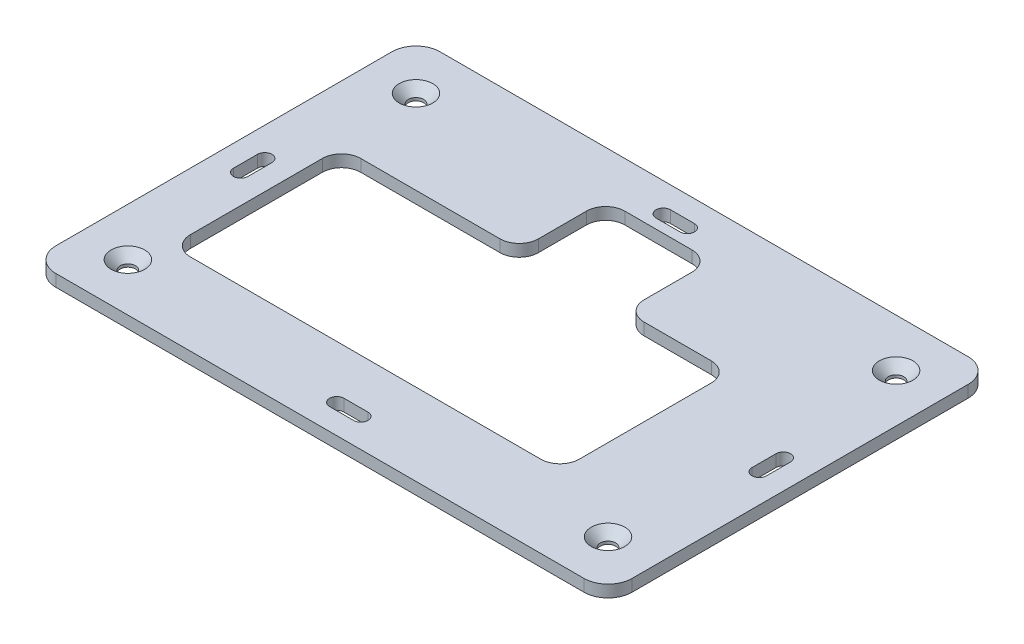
ISO-10303-21;
HEADER;
FILE_DESCRIPTION(('STEP AP214'),'2;1');
FILE_NAME('part.step','',(''),(''),'','','');
FILE_SCHEMA(('AUTOMOTIVE_DESIGN { 1 0 10303 214 1 1 1 1 }'));
ENDSEC;
DATA;
#1=APPLICATION_CONTEXT('core data for automotive mechanical design processes');
#2=APPLICATION_PROTOCOL_DEFINITION('international standard','automotive_design',2000,#1);
#3=PRODUCT_CONTEXT('',#1,'mechanical');
#4=PRODUCT('Part','Part','',(#3));
#5=PRODUCT_RELATED_PRODUCT_CATEGORY('part','',(#4));
#6=PRODUCT_DEFINITION_FORMATION('','',#4);
#7=PRODUCT_DEFINITION_CONTEXT('part definition',#1,'design');
#8=PRODUCT_DEFINITION('design','',#6,#7);
#9=PRODUCT_DEFINITION_SHAPE('','',#8);
#10=(LENGTH_UNIT() NAMED_UNIT(*) SI_UNIT(.MILLI.,.METRE.));
#11=(NAMED_UNIT(*) PLANE_ANGLE_UNIT() SI_UNIT($,.RADIAN.));
#12=(NAMED_UNIT(*) SI_UNIT($,.STERADIAN.) SOLID_ANGLE_UNIT());
#13=UNCERTAINTY_MEASURE_WITH_UNIT(LENGTH_MEASURE(1.E-05),#10,'distance_accuracy_value','');
#14=(GEOMETRIC_REPRESENTATION_CONTEXT(3) GLOBAL_UNCERTAINTY_ASSIGNED_CONTEXT((#13)) GLOBAL_UNIT_ASSIGNED_CONTEXT((#10,
#11,#12)) REPRESENTATION_CONTEXT('',''));
#15=CARTESIAN_POINT('',(0.,0.,0.));
#16=DIRECTION('',(0.,0.,1.));
#17=DIRECTION('',(1.,0.,0.));
#18=AXIS2_PLACEMENT_3D('',#15,#16,#17);
#19=CARTESIAN_POINT('',(-48.,0.,-12.5));
#20=DIRECTION('',(0.,0.,-1.));
#21=DIRECTION('',(-1.,0.,0.));
#22=AXIS2_PLACEMENT_3D('',#19,#20,#21);
#23=PLANE('',#22);
#24=DIRECTION('',(-1.,0.,0.));
#25=VECTOR('',#24,1.);
#26=CARTESIAN_POINT('',(-48.,2.5,-12.5));
#27=LINE('',#26,#25);
#28=CARTESIAN_POINT('',(-15.,2.5,-12.5));
#29=VERTEX_POINT('',#28);
#30=CARTESIAN_POINT('',(-44.,2.5,-12.5));
#31=VERTEX_POINT('',#30);
#32=EDGE_CURVE('E472',#29,#31,#27,.T.);
#33=ORIENTED_EDGE('',*,*,#32,.T.);
#34=DIRECTION('',(0.,1.,0.));
#35=VECTOR('',#34,1.);
#36=CARTESIAN_POINT('',(-44.,0.,-12.5));
#37=LINE('',#36,#35);
#38=CARTESIAN_POINT('',(-44.,0.,-12.5));
#39=VERTEX_POINT('',#38);
#40=EDGE_CURVE('E588',#31,#39,#37,.F.);
#41=ORIENTED_EDGE('',*,*,#40,.T.);
#42=DIRECTION('',(-1.,0.,0.));
#43=VECTOR('',#42,1.);
#44=CARTESIAN_POINT('',(-48.,0.,-12.5));
#45=LINE('',#44,#43);
#46=CARTESIAN_POINT('',(-15.,0.,-12.5));
#47=VERTEX_POINT('',#46);
#48=EDGE_CURVE('E458',#47,#39,#45,.T.);
#49=ORIENTED_EDGE('',*,*,#48,.F.);
#50=DIRECTION('',(0.,1.,0.));
#51=VECTOR('',#50,1.);
#52=CARTESIAN_POINT('',(-15.,0.,-12.5));
#53=LINE('',#52,#51);
#54=EDGE_CURVE('E585',#47,#29,#53,.T.);
#55=ORIENTED_EDGE('',*,*,#54,.T.);
#56=EDGE_LOOP('',(#33,#41,#49,#55));
#57=FACE_BOUND('',#56,.T.);
#58=ADVANCED_FACE('F34',(#57),#23,.F.);
#59=CARTESIAN_POINT('',(60.,2.5,40.));
#60=DIRECTION('',(-1.,0.,0.));
#61=DIRECTION('',(0.,0.,1.));
#62=AXIS2_PLACEMENT_3D('',#59,#60,#61);
#63=PLANE('',#62);
#64=DIRECTION('',(0.,0.,-1.));
#65=VECTOR('',#64,1.);
#66=CARTESIAN_POINT('',(60.,0.,40.));
#67=LINE('',#66,#65);
#68=CARTESIAN_POINT('',(60.,0.,35.));
#69=VERTEX_POINT('',#68);
#70=CARTESIAN_POINT('',(60.,0.,-35.));
#71=VERTEX_POINT('',#70);
#72=EDGE_CURVE('E469',#69,#71,#67,.T.);
#73=ORIENTED_EDGE('',*,*,#72,.T.);
#74=DIRECTION('',(0.,-1.,0.));
#75=VECTOR('',#74,1.);
#76=CARTESIAN_POINT('',(60.,2.5,-35.));
#77=LINE('',#76,#75);
#78=CARTESIAN_POINT('',(60.,2.5,-35.));
#79=VERTEX_POINT('',#78);
#80=EDGE_CURVE('E533',#71,#79,#77,.F.);
#81=ORIENTED_EDGE('',*,*,#80,.T.);
#82=DIRECTION('',(0.,0.,-1.));
#83=VECTOR('',#82,1.);
#84=CARTESIAN_POINT('',(60.,2.5,40.));
#85=LINE('',#84,#83);
#86=CARTESIAN_POINT('',(60.,2.5,35.));
#87=VERTEX_POINT('',#86);
#88=EDGE_CURVE('E481',#87,#79,#85,.T.);
#89=ORIENTED_EDGE('',*,*,#88,.F.);
#90=DIRECTION('',(0.,-1.,0.));
#91=VECTOR('',#90,1.);
#92=CARTESIAN_POINT('',(60.,2.5,35.));
#93=LINE('',#92,#91);
#94=EDGE_CURVE('E530',#87,#69,#93,.T.);
#95=ORIENTED_EDGE('',*,*,#94,.T.);
#96=EDGE_LOOP('',(#73,#81,#89,#95));
#97=FACE_BOUND('',#96,.T.);
#98=ADVANCED_FACE('F718',(#97),#63,.F.);
#99=CARTESIAN_POINT('',(-60.,2.5,-40.));
#100=DIRECTION('',(0.,0.,1.));
#101=DIRECTION('',(1.,0.,0.));
#102=AXIS2_PLACEMENT_3D('',#99,#100,#101);
#103=PLANE('',#102);
#104=DIRECTION('',(-1.,0.,0.));
#105=VECTOR('',#104,1.);
#106=CARTESIAN_POINT('',(-60.,0.,-40.));
#107=LINE('',#106,#105);
#108=CARTESIAN_POINT('',(55.,0.,-40.));
#109=VERTEX_POINT('',#108);
#110=CARTESIAN_POINT('',(-55.,0.,-40.));
#111=VERTEX_POINT('',#110);
#112=EDGE_CURVE('E497',#109,#111,#107,.T.);
#113=ORIENTED_EDGE('',*,*,#112,.T.);
#114=DIRECTION('',(0.,-1.,0.));
#115=VECTOR('',#114,1.);
#116=CARTESIAN_POINT('',(-55.,2.5,-40.));
#117=LINE('',#116,#115);
#118=CARTESIAN_POINT('',(-55.,2.5,-40.));
#119=VERTEX_POINT('',#118);
#120=EDGE_CURVE('E520',#111,#119,#117,.F.);
#121=ORIENTED_EDGE('',*,*,#120,.T.);
#122=DIRECTION('',(-1.,0.,0.));
#123=VECTOR('',#122,1.);
#124=CARTESIAN_POINT('',(-60.,2.5,-40.));
#125=LINE('',#124,#123);
#126=CARTESIAN_POINT('',(55.,2.5,-40.));
#127=VERTEX_POINT('',#126);
#128=EDGE_CURVE('E484',#127,#119,#125,.T.);
#129=ORIENTED_EDGE('',*,*,#128,.F.);
#130=DIRECTION('',(0.,-1.,0.));
#131=VECTOR('',#130,1.);
#132=CARTESIAN_POINT('',(55.,2.5,-40.));
#133=LINE('',#132,#131);
#134=EDGE_CURVE('E517',#127,#109,#133,.T.);
#135=ORIENTED_EDGE('',*,*,#134,.T.);
#136=EDGE_LOOP('',(#113,#121,#129,#135));
#137=FACE_BOUND('',#136,.T.);
#138=ADVANCED_FACE('F723',(#137),#103,.F.);
#139=CARTESIAN_POINT('',(-60.,2.5,40.));
#140=DIRECTION('',(1.,0.,0.));
#141=DIRECTION('',(0.,0.,-1.));
#142=AXIS2_PLACEMENT_3D('',#139,#140,#141);
#143=PLANE('',#142);
#144=DIRECTION('',(0.,0.,1.));
#145=VECTOR('',#144,1.);
#146=CARTESIAN_POINT('',(-60.,2.5,40.));
#147=LINE('',#146,#145);
#148=CARTESIAN_POINT('',(-60.,2.5,-35.));
#149=VERTEX_POINT('',#148);
#150=CARTESIAN_POINT('',(-60.,2.5,35.));
#151=VERTEX_POINT('',#150);
#152=EDGE_CURVE('E488',#149,#151,#147,.T.);
#153=ORIENTED_EDGE('',*,*,#152,.F.);
#154=DIRECTION('',(0.,-1.,0.));
#155=VECTOR('',#154,1.);
#156=CARTESIAN_POINT('',(-60.,2.5,-35.));
#157=LINE('',#156,#155);
#158=CARTESIAN_POINT('',(-60.,0.,-35.));
#159=VERTEX_POINT('',#158);
#160=EDGE_CURVE('E506',#149,#159,#157,.T.);
#161=ORIENTED_EDGE('',*,*,#160,.T.);
#162=DIRECTION('',(0.,0.,1.));
#163=VECTOR('',#162,1.);
#164=CARTESIAN_POINT('',(-60.,0.,40.));
#165=LINE('',#164,#163);
#166=CARTESIAN_POINT('',(-60.,0.,35.));
#167=VERTEX_POINT('',#166);
#168=EDGE_CURVE('E500',#159,#167,#165,.T.);
#169=ORIENTED_EDGE('',*,*,#168,.T.);
#170=DIRECTION('',(0.,-1.,0.));
#171=VECTOR('',#170,1.);
#172=CARTESIAN_POINT('',(-60.,2.5,35.));
#173=LINE('',#172,#171);
#174=EDGE_CURVE('E494',#167,#151,#173,.F.);
#175=ORIENTED_EDGE('',*,*,#174,.T.);
#176=EDGE_LOOP('',(#153,#161,#169,#175));
#177=FACE_BOUND('',#176,.T.);
#178=ADVANCED_FACE('F845',(#177),#143,.F.);
#179=CARTESIAN_POINT('',(-60.,2.5,40.));
#180=DIRECTION('',(0.,0.,-1.));
#181=DIRECTION('',(-1.,0.,0.));
#182=AXIS2_PLACEMENT_3D('',#179,#180,#181);
#183=PLANE('',#182);
#184=DIRECTION('',(1.,0.,0.));
#185=VECTOR('',#184,1.);
#186=CARTESIAN_POINT('',(-60.,2.5,40.));
#187=LINE('',#186,#185);
#188=CARTESIAN_POINT('',(-55.,2.5,40.));
#189=VERTEX_POINT('',#188);
#190=CARTESIAN_POINT('',(55.,2.5,40.));
#191=VERTEX_POINT('',#190);
#192=EDGE_CURVE('E491',#189,#191,#187,.T.);
#193=ORIENTED_EDGE('',*,*,#192,.F.);
#194=DIRECTION('',(0.,-1.,0.));
#195=VECTOR('',#194,1.);
#196=CARTESIAN_POINT('',(-55.,2.5,40.));
#197=LINE('',#196,#195);
#198=CARTESIAN_POINT('',(-55.,0.,40.));
#199=VERTEX_POINT('',#198);
#200=EDGE_CURVE('E537',#189,#199,#197,.T.);
#201=ORIENTED_EDGE('',*,*,#200,.T.);
#202=DIRECTION('',(1.,0.,0.));
#203=VECTOR('',#202,1.);
#204=CARTESIAN_POINT('',(-60.,0.,40.));
#205=LINE('',#204,#203);
#206=CARTESIAN_POINT('',(55.,0.,40.));
#207=VERTEX_POINT('',#206);
#208=EDGE_CURVE('E485',#199,#207,#205,.T.);
#209=ORIENTED_EDGE('',*,*,#208,.T.);
#210=DIRECTION('',(0.,-1.,0.));
#211=VECTOR('',#210,1.);
#212=CARTESIAN_POINT('',(55.,2.5,40.));
#213=LINE('',#212,#211);
#214=EDGE_CURVE('E535',#207,#191,#213,.F.);
#215=ORIENTED_EDGE('',*,*,#214,.T.);
#216=EDGE_LOOP('',(#193,#201,#209,#215));
#217=FACE_BOUND('',#216,.T.);
#218=ADVANCED_FACE('F820',(#217),#183,.F.);
#219=CARTESIAN_POINT('',(0.,2.5,0.));
#220=DIRECTION('',(0.,-1.,0.));
#221=DIRECTION('',(0.,0.,-1.));
#222=AXIS2_PLACEMENT_3D('',#219,#220,#221);
#223=PLANE('',#222);
#224=DIRECTION('',(-1.,0.,0.));
#225=VECTOR('',#224,1.);
#226=CARTESIAN_POINT('',(0.,2.5,35.5));
#227=LINE('',#226,#225);
#228=CARTESIAN_POINT('',(2.50000000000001,2.5,35.5));
#229=VERTEX_POINT('',#228);
#230=CARTESIAN_POINT('',(-2.49999999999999,2.5,35.5));
#231=VERTEX_POINT('',#230);
#232=EDGE_CURVE('E418',#229,#231,#227,.T.);
#233=ORIENTED_EDGE('',*,*,#232,.T.);
#234=CARTESIAN_POINT('',(-2.49999999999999,2.5,34.));
#235=DIRECTION('',(0.,-1.,0.));
#236=DIRECTION('',(0.,0.,-1.));
#237=AXIS2_PLACEMENT_3D('',#234,#235,#236);
#238=CIRCLE('',#237,1.5);
#239=CARTESIAN_POINT('',(-2.49999999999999,2.5,32.5));
#240=VERTEX_POINT('',#239);
#241=EDGE_CURVE('E421',#231,#240,#238,.T.);
#242=ORIENTED_EDGE('',*,*,#241,.T.);
#243=DIRECTION('',(1.,0.,0.));
#244=VECTOR('',#243,1.);
#245=CARTESIAN_POINT('',(0.,2.5,32.5));
#246=LINE('',#245,#244);
#247=CARTESIAN_POINT('',(2.50000000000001,2.5,32.5));
#248=VERTEX_POINT('',#247);
#249=EDGE_CURVE('E415',#240,#248,#246,.T.);
#250=ORIENTED_EDGE('',*,*,#249,.T.);
#251=CARTESIAN_POINT('',(2.49999999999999,2.5,34.));
#252=DIRECTION('',(0.,-1.,0.));
#253=DIRECTION('',(0.,0.,-1.));
#254=AXIS2_PLACEMENT_3D('',#251,#252,#253);
#255=CIRCLE('',#254,1.5);
#256=EDGE_CURVE('E295',#248,#229,#255,.T.);
#257=ORIENTED_EDGE('',*,*,#256,.T.);
#258=EDGE_LOOP('',(#233,#242,#250,#257));
#259=FACE_BOUND('',#258,.T.);
#260=DIRECTION('',(-1.,0.,0.));
#261=VECTOR('',#260,1.);
#262=CARTESIAN_POINT('',(0.,2.5,-32.5));
#263=LINE('',#262,#261);
#264=CARTESIAN_POINT('',(2.5,2.5,-32.5));
#265=VERTEX_POINT('',#264);
#266=CARTESIAN_POINT('',(-2.49999999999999,2.5,-32.5));
#267=VERTEX_POINT('',#266);
#268=EDGE_CURVE('E409',#265,#267,#263,.T.);
#269=ORIENTED_EDGE('',*,*,#268,.T.);
#270=CARTESIAN_POINT('',(-2.49999999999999,2.5,-34.));
#271=DIRECTION('',(0.,-1.,0.));
#272=DIRECTION('',(0.,0.,-1.));
#273=AXIS2_PLACEMENT_3D('',#270,#271,#272);
#274=CIRCLE('',#273,1.5);
#275=CARTESIAN_POINT('',(-2.49999999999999,2.5,-35.5));
#276=VERTEX_POINT('',#275);
#277=EDGE_CURVE('E412',#267,#276,#274,.T.);
#278=ORIENTED_EDGE('',*,*,#277,.T.);
#279=DIRECTION('',(1.,0.,0.));
#280=VECTOR('',#279,1.);
#281=CARTESIAN_POINT('',(0.,2.5,-35.5));
#282=LINE('',#281,#280);
#283=CARTESIAN_POINT('',(2.5,2.5,-35.5));
#284=VERTEX_POINT('',#283);
#285=EDGE_CURVE('E403',#276,#284,#282,.T.);
#286=ORIENTED_EDGE('',*,*,#285,.T.);
#287=CARTESIAN_POINT('',(2.49999999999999,2.5,-34.));
#288=DIRECTION('',(0.,-1.,0.));
#289=DIRECTION('',(0.,0.,-1.));
#290=AXIS2_PLACEMENT_3D('',#287,#288,#289);
#291=CIRCLE('',#290,1.5);
#292=EDGE_CURVE('E406',#284,#265,#291,.T.);
#293=ORIENTED_EDGE('',*,*,#292,.T.);
#294=EDGE_LOOP('',(#269,#278,#286,#293));
#295=FACE_BOUND('',#294,.T.);
#296=DIRECTION('',(0.,0.,1.));
#297=VECTOR('',#296,1.);
#298=CARTESIAN_POINT('',(55.5,2.5,0.));
#299=LINE('',#298,#297);
#300=CARTESIAN_POINT('',(55.5,2.5,-2.5));
#301=VERTEX_POINT('',#300);
#302=CARTESIAN_POINT('',(55.5,2.5,2.5));
#303=VERTEX_POINT('',#302);
#304=EDGE_CURVE('E397',#301,#303,#299,.T.);
#305=ORIENTED_EDGE('',*,*,#304,.T.);
#306=CARTESIAN_POINT('',(54.,2.5,2.5));
#307=DIRECTION('',(0.,-1.,0.));
#308=DIRECTION('',(0.,0.,-1.));
#309=AXIS2_PLACEMENT_3D('',#306,#307,#308);
#310=CIRCLE('',#309,1.5);
#311=CARTESIAN_POINT('',(52.5,2.5,2.5));
#312=VERTEX_POINT('',#311);
#313=EDGE_CURVE('E400',#303,#312,#310,.T.);
#314=ORIENTED_EDGE('',*,*,#313,.T.);
#315=DIRECTION('',(0.,0.,-1.));
#316=VECTOR('',#315,1.);
#317=CARTESIAN_POINT('',(52.5,2.5,0.));
#318=LINE('',#317,#316);
#319=CARTESIAN_POINT('',(52.5,2.5,-2.5));
#320=VERTEX_POINT('',#319);
#321=EDGE_CURVE('E391',#312,#320,#318,.T.);
#322=ORIENTED_EDGE('',*,*,#321,.T.);
#323=CARTESIAN_POINT('',(54.,2.5,-2.5));
#324=DIRECTION('',(0.,-1.,0.));
#325=DIRECTION('',(0.,0.,-1.));
#326=AXIS2_PLACEMENT_3D('',#323,#324,#325);
#327=CIRCLE('',#326,1.5);
#328=EDGE_CURVE('E394',#320,#301,#327,.T.);
#329=ORIENTED_EDGE('',*,*,#328,.T.);
#330=EDGE_LOOP('',(#305,#314,#322,#329));
#331=FACE_BOUND('',#330,.T.);
#332=DIRECTION('',(0.,0.,1.));
#333=VECTOR('',#332,1.);
#334=CARTESIAN_POINT('',(-52.5,2.5,0.));
#335=LINE('',#334,#333);
#336=CARTESIAN_POINT('',(-52.5,2.5,-2.5));
#337=VERTEX_POINT('',#336);
#338=CARTESIAN_POINT('',(-52.5,2.5,2.5));
#339=VERTEX_POINT('',#338);
#340=EDGE_CURVE('E385',#337,#339,#335,.T.);
#341=ORIENTED_EDGE('',*,*,#340,.T.);
#342=CARTESIAN_POINT('',(-54.,2.5,2.5));
#343=DIRECTION('',(0.,-1.,0.));
#344=DIRECTION('',(0.,0.,-1.));
#345=AXIS2_PLACEMENT_3D('',#342,#343,#344);
#346=CIRCLE('',#345,1.5);
#347=CARTESIAN_POINT('',(-55.5,2.5,2.5));
#348=VERTEX_POINT('',#347);
#349=EDGE_CURVE('E388',#339,#348,#346,.T.);
#350=ORIENTED_EDGE('',*,*,#349,.T.);
#351=DIRECTION('',(0.,0.,-1.));
#352=VECTOR('',#351,1.);
#353=CARTESIAN_POINT('',(-55.5,2.5,0.));
#354=LINE('',#353,#352);
#355=CARTESIAN_POINT('',(-55.5,2.5,-2.5));
#356=VERTEX_POINT('',#355);
#357=EDGE_CURVE('E319',#348,#356,#354,.T.);
#358=ORIENTED_EDGE('',*,*,#357,.T.);
#359=CARTESIAN_POINT('',(-54.,2.5,-2.5));
#360=DIRECTION('',(0.,-1.,0.));
#361=DIRECTION('',(0.,0.,-1.));
#362=AXIS2_PLACEMENT_3D('',#359,#360,#361);
#363=CIRCLE('',#362,1.5);
#364=EDGE_CURVE('E382',#356,#337,#363,.T.);
#365=ORIENTED_EDGE('',*,*,#364,.T.);
#366=EDGE_LOOP('',(#341,#350,#358,#365));
#367=FACE_BOUND('',#366,.T.);
#368=DIRECTION('',(0.,0.,1.));
#369=VECTOR('',#368,1.);
#370=CARTESIAN_POINT('',(11.,2.5,-30.5));
#371=LINE('',#370,#369);
#372=CARTESIAN_POINT('',(11.,2.5,-26.5));
#373=VERTEX_POINT('',#372);
#374=CARTESIAN_POINT('',(11.,2.5,-16.5));
#375=VERTEX_POINT('',#374);
#376=EDGE_CURVE('E432',#373,#375,#371,.T.);
#377=ORIENTED_EDGE('',*,*,#376,.T.);
#378=CARTESIAN_POINT('',(15.,2.5,-16.5));
#379=DIRECTION('',(0.,-1.,0.));
#380=DIRECTION('',(0.,0.,-1.));
#381=AXIS2_PLACEMENT_3D('',#378,#379,#380);
#382=CIRCLE('',#381,4.);
#383=CARTESIAN_POINT('',(15.,2.5,-12.5));
#384=VERTEX_POINT('',#383);
#385=EDGE_CURVE('E610',#375,#384,#382,.F.);
#386=ORIENTED_EDGE('',*,*,#385,.T.);
#387=CARTESIAN_POINT('',(29.,2.5,-12.5));
#388=VERTEX_POINT('',#387);
#389=EDGE_CURVE('E475',#388,#384,#27,.T.);
#390=ORIENTED_EDGE('',*,*,#389,.F.);
#391=CARTESIAN_POINT('',(29.,2.5,-8.5));
#392=DIRECTION('',(0.,-1.,0.));
#393=DIRECTION('',(0.,0.,-1.));
#394=AXIS2_PLACEMENT_3D('',#391,#392,#393);
#395=CIRCLE('',#394,4.);
#396=CARTESIAN_POINT('',(33.,2.5,-8.5));
#397=VERTEX_POINT('',#396);
#398=EDGE_CURVE('E612',#388,#397,#395,.T.);
#399=ORIENTED_EDGE('',*,*,#398,.T.);
#400=DIRECTION('',(0.,0.,-1.));
#401=VECTOR('',#400,1.);
#402=CARTESIAN_POINT('',(33.,2.5,23.));
#403=LINE('',#402,#401);
#404=CARTESIAN_POINT('',(33.,2.5,19.));
#405=VERTEX_POINT('',#404);
#406=EDGE_CURVE('E454',#405,#397,#403,.T.);
#407=ORIENTED_EDGE('',*,*,#406,.F.);
#408=CARTESIAN_POINT('',(29.,2.5,19.));
#409=DIRECTION('',(0.,-1.,0.));
#410=DIRECTION('',(0.,0.,-1.));
#411=AXIS2_PLACEMENT_3D('',#408,#409,#410);
#412=CIRCLE('',#411,4.);
#413=CARTESIAN_POINT('',(29.,2.5,23.));
#414=VERTEX_POINT('',#413);
#415=EDGE_CURVE('E616',#405,#414,#412,.T.);
#416=ORIENTED_EDGE('',*,*,#415,.T.);
#417=DIRECTION('',(1.,0.,0.));
#418=VECTOR('',#417,1.);
#419=CARTESIAN_POINT('',(-48.,2.5,23.));
#420=LINE('',#419,#418);
#421=CARTESIAN_POINT('',(-44.,2.5,23.));
#422=VERTEX_POINT('',#421);
#423=EDGE_CURVE('E459',#422,#414,#420,.T.);
#424=ORIENTED_EDGE('',*,*,#423,.F.);
#425=CARTESIAN_POINT('',(-44.,2.5,19.));
#426=DIRECTION('',(0.,-1.,0.));
#427=DIRECTION('',(0.,0.,-1.));
#428=AXIS2_PLACEMENT_3D('',#425,#426,#427);
#429=CIRCLE('',#428,4.);
#430=CARTESIAN_POINT('',(-48.,2.5,19.));
#431=VERTEX_POINT('',#430);
#432=EDGE_CURVE('E620',#422,#431,#429,.T.);
#433=ORIENTED_EDGE('',*,*,#432,.T.);
#434=DIRECTION('',(0.,0.,1.));
#435=VECTOR('',#434,1.);
#436=CARTESIAN_POINT('',(-48.,2.5,23.));
#437=LINE('',#436,#435);
#438=CARTESIAN_POINT('',(-48.,2.5,-8.5));
#439=VERTEX_POINT('',#438);
#440=EDGE_CURVE('E476',#439,#431,#437,.T.);
#441=ORIENTED_EDGE('',*,*,#440,.F.);
#442=CARTESIAN_POINT('',(-44.,2.5,-8.5));
#443=DIRECTION('',(0.,-1.,0.));
#444=DIRECTION('',(0.,0.,-1.));
#445=AXIS2_PLACEMENT_3D('',#442,#443,#444);
#446=CIRCLE('',#445,4.);
#447=EDGE_CURVE('E624',#439,#31,#446,.T.);
#448=ORIENTED_EDGE('',*,*,#447,.T.);
#449=ORIENTED_EDGE('',*,*,#32,.F.);
#450=CARTESIAN_POINT('',(-15.,2.5,-16.5));
#451=DIRECTION('',(0.,-1.,0.));
#452=DIRECTION('',(0.,0.,-1.));
#453=AXIS2_PLACEMENT_3D('',#450,#451,#452);
#454=CIRCLE('',#453,4.);
#455=CARTESIAN_POINT('',(-11.,2.5,-16.5));
#456=VERTEX_POINT('',#455);
#457=EDGE_CURVE('E608',#29,#456,#454,.F.);
#458=ORIENTED_EDGE('',*,*,#457,.T.);
#459=DIRECTION('',(0.,0.,-1.));
#460=VECTOR('',#459,1.);
#461=CARTESIAN_POINT('',(-11.,2.5,-30.5));
#462=LINE('',#461,#460);
#463=CARTESIAN_POINT('',(-11.,2.5,-26.5));
#464=VERTEX_POINT('',#463);
#465=EDGE_CURVE('E425',#456,#464,#462,.T.);
#466=ORIENTED_EDGE('',*,*,#465,.T.);
#467=CARTESIAN_POINT('',(-6.99999999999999,2.5,-26.5));
#468=DIRECTION('',(0.,-1.,0.));
#469=DIRECTION('',(0.,0.,-1.));
#470=AXIS2_PLACEMENT_3D('',#467,#468,#469);
#471=CIRCLE('',#470,4.);
#472=CARTESIAN_POINT('',(-6.99999999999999,2.5,-30.5));
#473=VERTEX_POINT('',#472);
#474=EDGE_CURVE('E11',#464,#473,#471,.T.);
#475=ORIENTED_EDGE('',*,*,#474,.T.);
#476=DIRECTION('',(1.,0.,0.));
#477=VECTOR('',#476,1.);
#478=CARTESIAN_POINT('',(-11.,2.5,-30.5));
#479=LINE('',#478,#477);
#480=CARTESIAN_POINT('',(7.00000000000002,2.5,-30.5));
#481=VERTEX_POINT('',#480);
#482=EDGE_CURVE('E428',#473,#481,#479,.T.);
#483=ORIENTED_EDGE('',*,*,#482,.T.);
#484=CARTESIAN_POINT('',(7.00000000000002,2.5,-26.5));
#485=DIRECTION('',(0.,-1.,0.));
#486=DIRECTION('',(0.,0.,-1.));
#487=AXIS2_PLACEMENT_3D('',#484,#485,#486);
#488=CIRCLE('',#487,4.);
#489=EDGE_CURVE('E630',#481,#373,#488,.T.);
#490=ORIENTED_EDGE('',*,*,#489,.T.);
#491=EDGE_LOOP('',(#377,#386,#390,#399,#407,#416,#424,#433,#441,#448,#449,#458,#466,#475,#483,#490));
#492=FACE_BOUND('',#491,.T.);
#493=CARTESIAN_POINT('',(-50.,2.5,30.));
#494=DIRECTION('',(0.,-1.,0.));
#495=DIRECTION('',(0.,0.,-1.));
#496=AXIS2_PLACEMENT_3D('',#493,#494,#495);
#497=CIRCLE('',#496,3.49999999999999);
#498=CARTESIAN_POINT('',(-50.,2.5,26.5));
#499=VERTEX_POINT('',#498);
#500=EDGE_CURVE('E552',#499,#499,#497,.T.);
#501=ORIENTED_EDGE('',*,*,#500,.T.);
#502=EDGE_LOOP('',(#501));
#503=FACE_BOUND('',#502,.T.);
#504=CARTESIAN_POINT('',(50.,2.5,30.));
#505=DIRECTION('',(0.,-1.,0.));
#506=DIRECTION('',(0.,0.,-1.));
#507=AXIS2_PLACEMENT_3D('',#504,#505,#506);
#508=CIRCLE('',#507,3.49999999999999);
#509=CARTESIAN_POINT('',(50.,2.5,26.5));
#510=VERTEX_POINT('',#509);
#511=EDGE_CURVE('E549',#510,#510,#508,.T.);
#512=ORIENTED_EDGE('',*,*,#511,.T.);
#513=EDGE_LOOP('',(#512));
#514=FACE_BOUND('',#513,.T.);
#515=CARTESIAN_POINT('',(50.,2.5,-30.));
#516=DIRECTION('',(0.,-1.,0.));
#517=DIRECTION('',(0.,0.,-1.));
#518=AXIS2_PLACEMENT_3D('',#515,#516,#517);
#519=CIRCLE('',#518,3.49999999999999);
#520=CARTESIAN_POINT('',(50.,2.5,-33.5));
#521=VERTEX_POINT('',#520);
#522=EDGE_CURVE('E546',#521,#521,#519,.T.);
#523=ORIENTED_EDGE('',*,*,#522,.T.);
#524=EDGE_LOOP('',(#523));
#525=FACE_BOUND('',#524,.T.);
#526=CARTESIAN_POINT('',(-50.,2.5,-30.));
#527=DIRECTION('',(0.,-1.,0.));
#528=DIRECTION('',(0.,0.,-1.));
#529=AXIS2_PLACEMENT_3D('',#526,#527,#528);
#530=CIRCLE('',#529,3.49999999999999);
#531=CARTESIAN_POINT('',(-50.,2.5,-33.5));
#532=VERTEX_POINT('',#531);
#533=EDGE_CURVE('E543',#532,#532,#530,.T.);
#534=ORIENTED_EDGE('',*,*,#533,.T.);
#535=EDGE_LOOP('',(#534));
#536=FACE_BOUND('',#535,.T.);
#537=ORIENTED_EDGE('',*,*,#128,.T.);
#538=CARTESIAN_POINT('',(-55.,2.5,-35.));
#539=DIRECTION('',(0.,-1.,0.));
#540=DIRECTION('',(0.,0.,-1.));
#541=AXIS2_PLACEMENT_3D('',#538,#539,#540);
#542=CIRCLE('',#541,5.);
#543=EDGE_CURVE('E528',#119,#149,#542,.F.);
#544=ORIENTED_EDGE('',*,*,#543,.T.);
#545=ORIENTED_EDGE('',*,*,#152,.T.);
#546=CARTESIAN_POINT('',(-55.,2.5,35.));
#547=DIRECTION('',(0.,-1.,0.));
#548=DIRECTION('',(0.,0.,-1.));
#549=AXIS2_PLACEMENT_3D('',#546,#547,#548);
#550=CIRCLE('',#549,5.);
#551=EDGE_CURVE('E524',#151,#189,#550,.F.);
#552=ORIENTED_EDGE('',*,*,#551,.T.);
#553=ORIENTED_EDGE('',*,*,#192,.T.);
#554=CARTESIAN_POINT('',(55.,2.5,35.));
#555=DIRECTION('',(0.,-1.,0.));
#556=DIRECTION('',(0.,0.,-1.));
#557=AXIS2_PLACEMENT_3D('',#554,#555,#556);
#558=CIRCLE('',#557,5.);
#559=EDGE_CURVE('E522',#191,#87,#558,.F.);
#560=ORIENTED_EDGE('',*,*,#559,.T.);
#561=ORIENTED_EDGE('',*,*,#88,.T.);
#562=CARTESIAN_POINT('',(55.,2.5,-35.));
#563=DIRECTION('',(0.,-1.,0.));
#564=DIRECTION('',(0.,0.,-1.));
#565=AXIS2_PLACEMENT_3D('',#562,#563,#564);
#566=CIRCLE('',#565,5.);
#567=EDGE_CURVE('E526',#79,#127,#566,.F.);
#568=ORIENTED_EDGE('',*,*,#567,.T.);
#569=EDGE_LOOP('',(#537,#544,#545,#552,#553,#560,#561,#568));
#570=FACE_BOUND('',#569,.T.);
#571=ADVANCED_FACE('F648',(#259,#295,#331,#367,#492,#503,#514,#525,#536,#570),#223,.F.);
#572=CARTESIAN_POINT('',(0.,0.,0.));
#573=DIRECTION('',(0.,-1.,0.));
#574=DIRECTION('',(0.,0.,-1.));
#575=AXIS2_PLACEMENT_3D('',#572,#573,#574);
#576=PLANE('',#575);
#577=CARTESIAN_POINT('',(-2.49999999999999,0.,34.));
#578=DIRECTION('',(0.,-1.,0.));
#579=DIRECTION('',(0.,0.,-1.));
#580=AXIS2_PLACEMENT_3D('',#577,#578,#579);
#581=CIRCLE('',#580,1.5);
#582=CARTESIAN_POINT('',(-2.49999999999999,0.,35.5));
#583=VERTEX_POINT('',#582);
#584=CARTESIAN_POINT('',(-2.49999999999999,0.,32.5));
#585=VERTEX_POINT('',#584);
#586=EDGE_CURVE('E307',#583,#585,#581,.T.);
#587=ORIENTED_EDGE('',*,*,#586,.F.);
#588=DIRECTION('',(-1.,0.,0.));
#589=VECTOR('',#588,1.);
#590=CARTESIAN_POINT('',(-2.49999999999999,0.,35.5));
#591=LINE('',#590,#589);
#592=CARTESIAN_POINT('',(2.50000000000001,0.,35.5));
#593=VERTEX_POINT('',#592);
#594=EDGE_CURVE('E312',#593,#583,#591,.T.);
#595=ORIENTED_EDGE('',*,*,#594,.F.);
#596=CARTESIAN_POINT('',(2.49999999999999,0.,34.));
#597=DIRECTION('',(0.,-1.,0.));
#598=DIRECTION('',(0.,0.,-1.));
#599=AXIS2_PLACEMENT_3D('',#596,#597,#598);
#600=CIRCLE('',#599,1.5);
#601=CARTESIAN_POINT('',(2.50000000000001,0.,32.5));
#602=VERTEX_POINT('',#601);
#603=EDGE_CURVE('E292',#602,#593,#600,.T.);
#604=ORIENTED_EDGE('',*,*,#603,.F.);
#605=DIRECTION('',(1.,0.,0.));
#606=VECTOR('',#605,1.);
#607=CARTESIAN_POINT('',(-2.49999999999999,0.,32.5));
#608=LINE('',#607,#606);
#609=EDGE_CURVE('E302',#585,#602,#608,.T.);
#610=ORIENTED_EDGE('',*,*,#609,.F.);
#611=EDGE_LOOP('',(#587,#595,#604,#610));
#612=FACE_BOUND('',#611,.T.);
#613=CARTESIAN_POINT('',(-2.49999999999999,0.,-34.));
#614=DIRECTION('',(0.,-1.,0.));
#615=DIRECTION('',(0.,0.,-1.));
#616=AXIS2_PLACEMENT_3D('',#613,#614,#615);
#617=CIRCLE('',#616,1.5);
#618=CARTESIAN_POINT('',(-2.49999999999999,0.,-32.5));
#619=VERTEX_POINT('',#618);
#620=CARTESIAN_POINT('',(-2.49999999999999,0.,-35.5));
#621=VERTEX_POINT('',#620);
#622=EDGE_CURVE('E322',#619,#621,#617,.T.);
#623=ORIENTED_EDGE('',*,*,#622,.F.);
#624=DIRECTION('',(-1.,0.,0.));
#625=VECTOR('',#624,1.);
#626=CARTESIAN_POINT('',(-2.49999999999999,0.,-32.5));
#627=LINE('',#626,#625);
#628=CARTESIAN_POINT('',(2.5,0.,-32.5));
#629=VERTEX_POINT('',#628);
#630=EDGE_CURVE('E330',#629,#619,#627,.T.);
#631=ORIENTED_EDGE('',*,*,#630,.F.);
#632=CARTESIAN_POINT('',(2.49999999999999,0.,-34.));
#633=DIRECTION('',(0.,-1.,0.));
#634=DIRECTION('',(0.,0.,-1.));
#635=AXIS2_PLACEMENT_3D('',#632,#633,#634);
#636=CIRCLE('',#635,1.5);
#637=CARTESIAN_POINT('',(2.5,0.,-35.5));
#638=VERTEX_POINT('',#637);
#639=EDGE_CURVE('E327',#638,#629,#636,.T.);
#640=ORIENTED_EDGE('',*,*,#639,.F.);
#641=DIRECTION('',(1.,0.,0.));
#642=VECTOR('',#641,1.);
#643=CARTESIAN_POINT('',(-2.49999999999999,0.,-35.5));
#644=LINE('',#643,#642);
#645=EDGE_CURVE('E324',#621,#638,#644,.T.);
#646=ORIENTED_EDGE('',*,*,#645,.F.);
#647=EDGE_LOOP('',(#623,#631,#640,#646));
#648=FACE_BOUND('',#647,.T.);
#649=CARTESIAN_POINT('',(54.,0.,2.5));
#650=DIRECTION('',(0.,-1.,0.));
#651=DIRECTION('',(0.,0.,-1.));
#652=AXIS2_PLACEMENT_3D('',#649,#650,#651);
#653=CIRCLE('',#652,1.5);
#654=CARTESIAN_POINT('',(55.5,0.,2.5));
#655=VERTEX_POINT('',#654);
#656=CARTESIAN_POINT('',(52.5,0.,2.5));
#657=VERTEX_POINT('',#656);
#658=EDGE_CURVE('E341',#655,#657,#653,.T.);
#659=ORIENTED_EDGE('',*,*,#658,.F.);
#660=DIRECTION('',(0.,0.,1.));
#661=VECTOR('',#660,1.);
#662=CARTESIAN_POINT('',(55.5,0.,2.5));
#663=LINE('',#662,#661);
#664=CARTESIAN_POINT('',(55.5,0.,-2.5));
#665=VERTEX_POINT('',#664);
#666=EDGE_CURVE('E350',#665,#655,#663,.T.);
#667=ORIENTED_EDGE('',*,*,#666,.F.);
#668=CARTESIAN_POINT('',(54.,0.,-2.5));
#669=DIRECTION('',(0.,-1.,0.));
#670=DIRECTION('',(0.,0.,-1.));
#671=AXIS2_PLACEMENT_3D('',#668,#669,#670);
#672=CIRCLE('',#671,1.5);
#673=CARTESIAN_POINT('',(52.5,0.,-2.5));
#674=VERTEX_POINT('',#673);
#675=EDGE_CURVE('E347',#674,#665,#672,.T.);
#676=ORIENTED_EDGE('',*,*,#675,.F.);
#677=DIRECTION('',(0.,0.,-1.));
#678=VECTOR('',#677,1.);
#679=CARTESIAN_POINT('',(52.5,0.,2.5));
#680=LINE('',#679,#678);
#681=EDGE_CURVE('E343',#657,#674,#680,.T.);
#682=ORIENTED_EDGE('',*,*,#681,.F.);
#683=EDGE_LOOP('',(#659,#667,#676,#682));
#684=FACE_BOUND('',#683,.T.);
#685=CARTESIAN_POINT('',(-54.,0.,2.5));
#686=DIRECTION('',(0.,-1.,0.));
#687=DIRECTION('',(0.,0.,-1.));
#688=AXIS2_PLACEMENT_3D('',#685,#686,#687);
#689=CIRCLE('',#688,1.5);
#690=CARTESIAN_POINT('',(-52.5,0.,2.5));
#691=VERTEX_POINT('',#690);
#692=CARTESIAN_POINT('',(-55.5,0.,2.5));
#693=VERTEX_POINT('',#692);
#694=EDGE_CURVE('E361',#691,#693,#689,.T.);
#695=ORIENTED_EDGE('',*,*,#694,.F.);
#696=DIRECTION('',(0.,0.,1.));
#697=VECTOR('',#696,1.);
#698=CARTESIAN_POINT('',(-52.5,0.,2.5));
#699=LINE('',#698,#697);
#700=CARTESIAN_POINT('',(-52.5,0.,-2.5));
#701=VERTEX_POINT('',#700);
#702=EDGE_CURVE('E369',#701,#691,#699,.T.);
#703=ORIENTED_EDGE('',*,*,#702,.F.);
#704=CARTESIAN_POINT('',(-54.,0.,-2.5));
#705=DIRECTION('',(0.,-1.,0.));
#706=DIRECTION('',(0.,0.,-1.));
#707=AXIS2_PLACEMENT_3D('',#704,#705,#706);
#708=CIRCLE('',#707,1.5);
#709=CARTESIAN_POINT('',(-55.5,0.,-2.5));
#710=VERTEX_POINT('',#709);
#711=EDGE_CURVE('E366',#710,#701,#708,.T.);
#712=ORIENTED_EDGE('',*,*,#711,.F.);
#713=DIRECTION('',(0.,0.,-1.));
#714=VECTOR('',#713,1.);
#715=CARTESIAN_POINT('',(-55.5,0.,2.5));
#716=LINE('',#715,#714);
#717=EDGE_CURVE('E363',#693,#710,#716,.T.);
#718=ORIENTED_EDGE('',*,*,#717,.F.);
#719=EDGE_LOOP('',(#695,#703,#712,#718));
#720=FACE_BOUND('',#719,.T.);
#721=CARTESIAN_POINT('',(29.,0.,-12.5));
#722=VERTEX_POINT('',#721);
#723=CARTESIAN_POINT('',(15.,0.,-12.5));
#724=VERTEX_POINT('',#723);
#725=EDGE_CURVE('E462',#722,#724,#45,.T.);
#726=ORIENTED_EDGE('',*,*,#725,.T.);
#727=CARTESIAN_POINT('',(15.,0.,-16.5));
#728=DIRECTION('',(0.,-1.,0.));
#729=DIRECTION('',(0.,0.,-1.));
#730=AXIS2_PLACEMENT_3D('',#727,#728,#729);
#731=CIRCLE('',#730,4.);
#732=CARTESIAN_POINT('',(11.,0.,-16.5));
#733=VERTEX_POINT('',#732);
#734=EDGE_CURVE('E606',#724,#733,#731,.T.);
#735=ORIENTED_EDGE('',*,*,#734,.T.);
#736=DIRECTION('',(0.,0.,1.));
#737=VECTOR('',#736,1.);
#738=CARTESIAN_POINT('',(11.,0.,-30.5));
#739=LINE('',#738,#737);
#740=CARTESIAN_POINT('',(11.,0.,-26.5));
#741=VERTEX_POINT('',#740);
#742=EDGE_CURVE('E429',#741,#733,#739,.T.);
#743=ORIENTED_EDGE('',*,*,#742,.F.);
#744=CARTESIAN_POINT('',(7.00000000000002,0.,-26.5));
#745=DIRECTION('',(0.,-1.,0.));
#746=DIRECTION('',(0.,0.,-1.));
#747=AXIS2_PLACEMENT_3D('',#744,#745,#746);
#748=CIRCLE('',#747,4.);
#749=CARTESIAN_POINT('',(7.00000000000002,0.,-30.5));
#750=VERTEX_POINT('',#749);
#751=EDGE_CURVE('E628',#741,#750,#748,.F.);
#752=ORIENTED_EDGE('',*,*,#751,.T.);
#753=DIRECTION('',(1.,0.,0.));
#754=VECTOR('',#753,1.);
#755=CARTESIAN_POINT('',(-11.,0.,-30.5));
#756=LINE('',#755,#754);
#757=CARTESIAN_POINT('',(-6.99999999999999,0.,-30.5));
#758=VERTEX_POINT('',#757);
#759=EDGE_CURVE('E438',#758,#750,#756,.T.);
#760=ORIENTED_EDGE('',*,*,#759,.F.);
#761=CARTESIAN_POINT('',(-6.99999999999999,0.,-26.5));
#762=DIRECTION('',(0.,-1.,0.));
#763=DIRECTION('',(0.,0.,-1.));
#764=AXIS2_PLACEMENT_3D('',#761,#762,#763);
#765=CIRCLE('',#764,4.);
#766=CARTESIAN_POINT('',(-11.,0.,-26.5));
#767=VERTEX_POINT('',#766);
#768=EDGE_CURVE('E42',#758,#767,#765,.F.);
#769=ORIENTED_EDGE('',*,*,#768,.T.);
#770=DIRECTION('',(0.,0.,-1.));
#771=VECTOR('',#770,1.);
#772=CARTESIAN_POINT('',(-11.,0.,-30.5));
#773=LINE('',#772,#771);
#774=CARTESIAN_POINT('',(-11.,0.,-16.5));
#775=VERTEX_POINT('',#774);
#776=EDGE_CURVE('E424',#775,#767,#773,.T.);
#777=ORIENTED_EDGE('',*,*,#776,.F.);
#778=CARTESIAN_POINT('',(-15.,0.,-16.5));
#779=DIRECTION('',(0.,-1.,0.));
#780=DIRECTION('',(0.,0.,-1.));
#781=AXIS2_PLACEMENT_3D('',#778,#779,#780);
#782=CIRCLE('',#781,4.);
#783=EDGE_CURVE('E604',#775,#47,#782,.T.);
#784=ORIENTED_EDGE('',*,*,#783,.T.);
#785=ORIENTED_EDGE('',*,*,#48,.T.);
#786=CARTESIAN_POINT('',(-44.,0.,-8.5));
#787=DIRECTION('',(0.,-1.,0.));
#788=DIRECTION('',(0.,0.,-1.));
#789=AXIS2_PLACEMENT_3D('',#786,#787,#788);
#790=CIRCLE('',#789,4.);
#791=CARTESIAN_POINT('',(-48.,0.,-8.5));
#792=VERTEX_POINT('',#791);
#793=EDGE_CURVE('E626',#39,#792,#790,.F.);
#794=ORIENTED_EDGE('',*,*,#793,.T.);
#795=DIRECTION('',(0.,0.,1.));
#796=VECTOR('',#795,1.);
#797=CARTESIAN_POINT('',(-48.,0.,23.));
#798=LINE('',#797,#796);
#799=CARTESIAN_POINT('',(-48.,0.,19.));
#800=VERTEX_POINT('',#799);
#801=EDGE_CURVE('E463',#792,#800,#798,.T.);
#802=ORIENTED_EDGE('',*,*,#801,.T.);
#803=CARTESIAN_POINT('',(-44.,0.,19.));
#804=DIRECTION('',(0.,-1.,0.));
#805=DIRECTION('',(0.,0.,-1.));
#806=AXIS2_PLACEMENT_3D('',#803,#804,#805);
#807=CIRCLE('',#806,4.);
#808=CARTESIAN_POINT('',(-44.,0.,23.));
#809=VERTEX_POINT('',#808);
#810=EDGE_CURVE('E622',#800,#809,#807,.F.);
#811=ORIENTED_EDGE('',*,*,#810,.T.);
#812=DIRECTION('',(1.,0.,0.));
#813=VECTOR('',#812,1.);
#814=CARTESIAN_POINT('',(-48.,0.,23.));
#815=LINE('',#814,#813);
#816=CARTESIAN_POINT('',(29.,0.,23.));
#817=VERTEX_POINT('',#816);
#818=EDGE_CURVE('E466',#809,#817,#815,.T.);
#819=ORIENTED_EDGE('',*,*,#818,.T.);
#820=CARTESIAN_POINT('',(29.,0.,19.));
#821=DIRECTION('',(0.,-1.,0.));
#822=DIRECTION('',(0.,0.,-1.));
#823=AXIS2_PLACEMENT_3D('',#820,#821,#822);
#824=CIRCLE('',#823,4.);
#825=CARTESIAN_POINT('',(33.,0.,19.));
#826=VERTEX_POINT('',#825);
#827=EDGE_CURVE('E618',#817,#826,#824,.F.);
#828=ORIENTED_EDGE('',*,*,#827,.T.);
#829=DIRECTION('',(0.,0.,-1.));
#830=VECTOR('',#829,1.);
#831=CARTESIAN_POINT('',(33.,0.,23.));
#832=LINE('',#831,#830);
#833=CARTESIAN_POINT('',(33.,0.,-8.5));
#834=VERTEX_POINT('',#833);
#835=EDGE_CURVE('E455',#826,#834,#832,.T.);
#836=ORIENTED_EDGE('',*,*,#835,.T.);
#837=CARTESIAN_POINT('',(29.,0.,-8.5));
#838=DIRECTION('',(0.,-1.,0.));
#839=DIRECTION('',(0.,0.,-1.));
#840=AXIS2_PLACEMENT_3D('',#837,#838,#839);
#841=CIRCLE('',#840,4.);
#842=EDGE_CURVE('E614',#834,#722,#841,.F.);
#843=ORIENTED_EDGE('',*,*,#842,.T.);
#844=EDGE_LOOP('',(#726,#735,#743,#752,#760,#769,#777,#784,#785,#794,#802,#811,#819,#828,#836,#843));
#845=FACE_BOUND('',#844,.T.);
#846=CARTESIAN_POINT('',(-50.,0.,30.));
#847=DIRECTION('',(0.,1.,0.));
#848=DIRECTION('',(0.,0.,1.));
#849=AXIS2_PLACEMENT_3D('',#846,#847,#848);
#850=CIRCLE('',#849,1.6);
#851=CARTESIAN_POINT('',(-50.,0.,31.6));
#852=VERTEX_POINT('',#851);
#853=EDGE_CURVE('E435',#852,#852,#850,.T.);
#854=ORIENTED_EDGE('',*,*,#853,.T.);
#855=EDGE_LOOP('',(#854));
#856=FACE_BOUND('',#855,.T.);
#857=CARTESIAN_POINT('',(50.,0.,30.));
#858=DIRECTION('',(0.,1.,0.));
#859=DIRECTION('',(0.,0.,1.));
#860=AXIS2_PLACEMENT_3D('',#857,#858,#859);
#861=CIRCLE('',#860,1.6);
#862=CARTESIAN_POINT('',(50.,0.,31.6));
#863=VERTEX_POINT('',#862);
#864=EDGE_CURVE('E447',#863,#863,#861,.T.);
#865=ORIENTED_EDGE('',*,*,#864,.T.);
#866=EDGE_LOOP('',(#865));
#867=FACE_BOUND('',#866,.T.);
#868=CARTESIAN_POINT('',(50.,0.,-30.));
#869=DIRECTION('',(0.,1.,0.));
#870=DIRECTION('',(0.,0.,1.));
#871=AXIS2_PLACEMENT_3D('',#868,#869,#870);
#872=CIRCLE('',#871,1.6);
#873=CARTESIAN_POINT('',(50.,0.,-28.4));
#874=VERTEX_POINT('',#873);
#875=EDGE_CURVE('E443',#874,#874,#872,.T.);
#876=ORIENTED_EDGE('',*,*,#875,.T.);
#877=EDGE_LOOP('',(#876));
#878=FACE_BOUND('',#877,.T.);
#879=CARTESIAN_POINT('',(-50.,0.,-30.));
#880=DIRECTION('',(0.,1.,0.));
#881=DIRECTION('',(0.,0.,1.));
#882=AXIS2_PLACEMENT_3D('',#879,#880,#881);
#883=CIRCLE('',#882,1.6);
#884=CARTESIAN_POINT('',(-50.,0.,-28.4));
#885=VERTEX_POINT('',#884);
#886=EDGE_CURVE('E446',#885,#885,#883,.T.);
#887=ORIENTED_EDGE('',*,*,#886,.T.);
#888=EDGE_LOOP('',(#887));
#889=FACE_BOUND('',#888,.T.);
#890=ORIENTED_EDGE('',*,*,#168,.F.);
#891=CARTESIAN_POINT('',(-55.,0.,-35.));
#892=DIRECTION('',(0.,-1.,0.));
#893=DIRECTION('',(0.,0.,-1.));
#894=AXIS2_PLACEMENT_3D('',#891,#892,#893);
#895=CIRCLE('',#894,5.);
#896=EDGE_CURVE('E515',#159,#111,#895,.T.);
#897=ORIENTED_EDGE('',*,*,#896,.T.);
#898=ORIENTED_EDGE('',*,*,#112,.F.);
#899=CARTESIAN_POINT('',(55.,0.,-35.));
#900=DIRECTION('',(0.,-1.,0.));
#901=DIRECTION('',(0.,0.,-1.));
#902=AXIS2_PLACEMENT_3D('',#899,#900,#901);
#903=CIRCLE('',#902,5.);
#904=EDGE_CURVE('E513',#109,#71,#903,.T.);
#905=ORIENTED_EDGE('',*,*,#904,.T.);
#906=ORIENTED_EDGE('',*,*,#72,.F.);
#907=CARTESIAN_POINT('',(55.,0.,35.));
#908=DIRECTION('',(0.,-1.,0.));
#909=DIRECTION('',(0.,0.,-1.));
#910=AXIS2_PLACEMENT_3D('',#907,#908,#909);
#911=CIRCLE('',#910,5.);
#912=EDGE_CURVE('E509',#69,#207,#911,.T.);
#913=ORIENTED_EDGE('',*,*,#912,.T.);
#914=ORIENTED_EDGE('',*,*,#208,.F.);
#915=CARTESIAN_POINT('',(-55.,0.,35.));
#916=DIRECTION('',(0.,-1.,0.));
#917=DIRECTION('',(0.,0.,-1.));
#918=AXIS2_PLACEMENT_3D('',#915,#916,#917);
#919=CIRCLE('',#918,5.);
#920=EDGE_CURVE('E511',#199,#167,#919,.T.);
#921=ORIENTED_EDGE('',*,*,#920,.T.);
#922=EDGE_LOOP('',(#890,#897,#898,#905,#906,#913,#914,#921));
#923=FACE_BOUND('',#922,.T.);
#924=ADVANCED_FACE('F309',(#612,#648,#684,#720,#845,#856,#867,#878,#889,#923),#576,.T.);
#925=CARTESIAN_POINT('',(-55.,2.5,-35.));
#926=DIRECTION('',(0.,-1.,0.));
#927=DIRECTION('',(0.,0.,-1.));
#928=AXIS2_PLACEMENT_3D('',#925,#926,#927);
#929=CYLINDRICAL_SURFACE('',#928,5.);
#930=ORIENTED_EDGE('',*,*,#543,.F.);
#931=ORIENTED_EDGE('',*,*,#120,.F.);
#932=ORIENTED_EDGE('',*,*,#896,.F.);
#933=ORIENTED_EDGE('',*,*,#160,.F.);
#934=EDGE_LOOP('',(#930,#931,#932,#933));
#935=FACE_BOUND('',#934,.T.);
#936=ADVANCED_FACE('F834',(#935),#929,.T.);
#937=CARTESIAN_POINT('',(55.,2.5,-35.));
#938=DIRECTION('',(0.,-1.,0.));
#939=DIRECTION('',(0.,0.,-1.));
#940=AXIS2_PLACEMENT_3D('',#937,#938,#939);
#941=CYLINDRICAL_SURFACE('',#940,5.);
#942=ORIENTED_EDGE('',*,*,#567,.F.);
#943=ORIENTED_EDGE('',*,*,#80,.F.);
#944=ORIENTED_EDGE('',*,*,#904,.F.);
#945=ORIENTED_EDGE('',*,*,#134,.F.);
#946=EDGE_LOOP('',(#942,#943,#944,#945));
#947=FACE_BOUND('',#946,.T.);
#948=ADVANCED_FACE('F839',(#947),#941,.T.);
#949=CARTESIAN_POINT('',(-55.,2.5,35.));
#950=DIRECTION('',(0.,-1.,0.));
#951=DIRECTION('',(0.,0.,-1.));
#952=AXIS2_PLACEMENT_3D('',#949,#950,#951);
#953=CYLINDRICAL_SURFACE('',#952,5.);
#954=ORIENTED_EDGE('',*,*,#551,.F.);
#955=ORIENTED_EDGE('',*,*,#174,.F.);
#956=ORIENTED_EDGE('',*,*,#920,.F.);
#957=ORIENTED_EDGE('',*,*,#200,.F.);
#958=EDGE_LOOP('',(#954,#955,#956,#957));
#959=FACE_BOUND('',#958,.T.);
#960=ADVANCED_FACE('F855',(#959),#953,.T.);
#961=CARTESIAN_POINT('',(55.,2.5,35.));
#962=DIRECTION('',(0.,-1.,0.));
#963=DIRECTION('',(0.,0.,-1.));
#964=AXIS2_PLACEMENT_3D('',#961,#962,#963);
#965=CYLINDRICAL_SURFACE('',#964,5.);
#966=ORIENTED_EDGE('',*,*,#559,.F.);
#967=ORIENTED_EDGE('',*,*,#214,.F.);
#968=ORIENTED_EDGE('',*,*,#912,.F.);
#969=ORIENTED_EDGE('',*,*,#94,.F.);
#970=EDGE_LOOP('',(#966,#967,#968,#969));
#971=FACE_BOUND('',#970,.T.);
#972=ADVANCED_FACE('F859',(#971),#965,.T.);
#973=CARTESIAN_POINT('',(33.,0.,23.));
#974=DIRECTION('',(1.,0.,0.));
#975=DIRECTION('',(0.,0.,-1.));
#976=AXIS2_PLACEMENT_3D('',#973,#974,#975);
#977=PLANE('',#976);
#978=ORIENTED_EDGE('',*,*,#406,.T.);
#979=DIRECTION('',(0.,1.,0.));
#980=VECTOR('',#979,1.);
#981=CARTESIAN_POINT('',(33.,0.,-8.5));
#982=LINE('',#981,#980);
#983=EDGE_CURVE('E573',#397,#834,#982,.F.);
#984=ORIENTED_EDGE('',*,*,#983,.T.);
#985=ORIENTED_EDGE('',*,*,#835,.F.);
#986=DIRECTION('',(0.,1.,0.));
#987=VECTOR('',#986,1.);
#988=CARTESIAN_POINT('',(33.,2.5,19.));
#989=LINE('',#988,#987);
#990=EDGE_CURVE('E570',#826,#405,#989,.T.);
#991=ORIENTED_EDGE('',*,*,#990,.T.);
#992=EDGE_LOOP('',(#978,#984,#985,#991));
#993=FACE_BOUND('',#992,.T.);
#994=ADVANCED_FACE('F678',(#993),#977,.F.);
#995=CARTESIAN_POINT('',(-48.,0.,23.));
#996=DIRECTION('',(0.,0.,1.));
#997=DIRECTION('',(1.,0.,0.));
#998=AXIS2_PLACEMENT_3D('',#995,#996,#997);
#999=PLANE('',#998);
#1000=ORIENTED_EDGE('',*,*,#423,.T.);
#1001=DIRECTION('',(0.,1.,0.));
#1002=VECTOR('',#1001,1.);
#1003=CARTESIAN_POINT('',(29.,0.,23.));
#1004=LINE('',#1003,#1002);
#1005=EDGE_CURVE('E578',#414,#817,#1004,.F.);
#1006=ORIENTED_EDGE('',*,*,#1005,.T.);
#1007=ORIENTED_EDGE('',*,*,#818,.F.);
#1008=DIRECTION('',(0.,1.,0.));
#1009=VECTOR('',#1008,1.);
#1010=CARTESIAN_POINT('',(-44.,2.5,23.));
#1011=LINE('',#1010,#1009);
#1012=EDGE_CURVE('E575',#809,#422,#1011,.T.);
#1013=ORIENTED_EDGE('',*,*,#1012,.T.);
#1014=EDGE_LOOP('',(#1000,#1006,#1007,#1013));
#1015=FACE_BOUND('',#1014,.T.);
#1016=ADVANCED_FACE('F687',(#1015),#999,.F.);
#1017=CARTESIAN_POINT('',(-48.,0.,23.));
#1018=DIRECTION('',(-1.,0.,0.));
#1019=DIRECTION('',(0.,0.,1.));
#1020=AXIS2_PLACEMENT_3D('',#1017,#1018,#1019);
#1021=PLANE('',#1020);
#1022=ORIENTED_EDGE('',*,*,#440,.T.);
#1023=DIRECTION('',(0.,1.,0.));
#1024=VECTOR('',#1023,1.);
#1025=CARTESIAN_POINT('',(-48.,0.,19.));
#1026=LINE('',#1025,#1024);
#1027=EDGE_CURVE('E583',#431,#800,#1026,.F.);
#1028=ORIENTED_EDGE('',*,*,#1027,.T.);
#1029=ORIENTED_EDGE('',*,*,#801,.F.);
#1030=DIRECTION('',(0.,1.,0.));
#1031=VECTOR('',#1030,1.);
#1032=CARTESIAN_POINT('',(-48.,2.5,-8.5));
#1033=LINE('',#1032,#1031);
#1034=EDGE_CURVE('E580',#792,#439,#1033,.T.);
#1035=ORIENTED_EDGE('',*,*,#1034,.T.);
#1036=EDGE_LOOP('',(#1022,#1028,#1029,#1035));
#1037=FACE_BOUND('',#1036,.T.);
#1038=ADVANCED_FACE('F696',(#1037),#1021,.F.);
#1039=ORIENTED_EDGE('',*,*,#725,.F.);
#1040=DIRECTION('',(0.,1.,0.));
#1041=VECTOR('',#1040,1.);
#1042=CARTESIAN_POINT('',(29.,2.5,-12.5));
#1043=LINE('',#1042,#1041);
#1044=EDGE_CURVE('E567',#722,#388,#1043,.T.);
#1045=ORIENTED_EDGE('',*,*,#1044,.T.);
#1046=ORIENTED_EDGE('',*,*,#389,.T.);
#1047=DIRECTION('',(0.,-1.,0.));
#1048=VECTOR('',#1047,1.);
#1049=CARTESIAN_POINT('',(15.,0.,-12.5));
#1050=LINE('',#1049,#1048);
#1051=EDGE_CURVE('E564',#384,#724,#1050,.T.);
#1052=ORIENTED_EDGE('',*,*,#1051,.T.);
#1053=EDGE_LOOP('',(#1039,#1045,#1046,#1052));
#1054=FACE_BOUND('',#1053,.T.);
#1055=ADVANCED_FACE('F670',(#1054),#23,.F.);
#1056=CARTESIAN_POINT('',(-50.,0.,-30.));
#1057=DIRECTION('',(0.,1.,0.));
#1058=DIRECTION('',(0.,0.,1.));
#1059=AXIS2_PLACEMENT_3D('',#1056,#1057,#1058);
#1060=CYLINDRICAL_SURFACE('',#1059,1.6);
#1061=CARTESIAN_POINT('',(-50.,0.600000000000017,-30.));
#1062=DIRECTION('',(0.,-1.,0.));
#1063=DIRECTION('',(0.,0.,-1.));
#1064=AXIS2_PLACEMENT_3D('',#1061,#1062,#1063);
#1065=CIRCLE('',#1064,1.6);
#1066=CARTESIAN_POINT('',(-50.,0.600000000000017,-31.6));
#1067=VERTEX_POINT('',#1066);
#1068=EDGE_CURVE('E561',#1067,#1067,#1065,.F.);
#1069=ORIENTED_EDGE('',*,*,#1068,.T.);
#1070=EDGE_LOOP('',(#1069));
#1071=FACE_BOUND('',#1070,.T.);
#1072=ORIENTED_EDGE('',*,*,#886,.F.);
#1073=EDGE_LOOP('',(#1072));
#1074=FACE_BOUND('',#1073,.T.);
#1075=ADVANCED_FACE('F729',(#1071,#1074),#1060,.F.);
#1076=CARTESIAN_POINT('',(50.,0.,-30.));
#1077=DIRECTION('',(0.,1.,0.));
#1078=DIRECTION('',(0.,0.,1.));
#1079=AXIS2_PLACEMENT_3D('',#1076,#1077,#1078);
#1080=CYLINDRICAL_SURFACE('',#1079,1.6);
#1081=CARTESIAN_POINT('',(50.,0.600000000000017,-30.));
#1082=DIRECTION('',(0.,-1.,0.));
#1083=DIRECTION('',(0.,0.,-1.));
#1084=AXIS2_PLACEMENT_3D('',#1081,#1082,#1083);
#1085=CIRCLE('',#1084,1.6);
#1086=CARTESIAN_POINT('',(50.,0.600000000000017,-31.6));
#1087=VERTEX_POINT('',#1086);
#1088=EDGE_CURVE('E558',#1087,#1087,#1085,.F.);
#1089=ORIENTED_EDGE('',*,*,#1088,.T.);
#1090=EDGE_LOOP('',(#1089));
#1091=FACE_BOUND('',#1090,.T.);
#1092=ORIENTED_EDGE('',*,*,#875,.F.);
#1093=EDGE_LOOP('',(#1092));
#1094=FACE_BOUND('',#1093,.T.);
#1095=ADVANCED_FACE('F734',(#1091,#1094),#1080,.F.);
#1096=CARTESIAN_POINT('',(50.,0.,30.));
#1097=DIRECTION('',(0.,1.,0.));
#1098=DIRECTION('',(0.,0.,1.));
#1099=AXIS2_PLACEMENT_3D('',#1096,#1097,#1098);
#1100=CYLINDRICAL_SURFACE('',#1099,1.6);
#1101=CARTESIAN_POINT('',(50.,0.600000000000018,30.));
#1102=DIRECTION('',(0.,-1.,0.));
#1103=DIRECTION('',(0.,0.,-1.));
#1104=AXIS2_PLACEMENT_3D('',#1101,#1102,#1103);
#1105=CIRCLE('',#1104,1.6);
#1106=CARTESIAN_POINT('',(50.,0.600000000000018,28.4));
#1107=VERTEX_POINT('',#1106);
#1108=EDGE_CURVE('E555',#1107,#1107,#1105,.F.);
#1109=ORIENTED_EDGE('',*,*,#1108,.T.);
#1110=EDGE_LOOP('',(#1109));
#1111=FACE_BOUND('',#1110,.T.);
#1112=ORIENTED_EDGE('',*,*,#864,.F.);
#1113=EDGE_LOOP('',(#1112));
#1114=FACE_BOUND('',#1113,.T.);
#1115=ADVANCED_FACE('F746',(#1111,#1114),#1100,.F.);
#1116=CARTESIAN_POINT('',(-50.,0.,30.));
#1117=DIRECTION('',(0.,1.,0.));
#1118=DIRECTION('',(0.,0.,1.));
#1119=AXIS2_PLACEMENT_3D('',#1116,#1117,#1118);
#1120=CYLINDRICAL_SURFACE('',#1119,1.6);
#1121=CARTESIAN_POINT('',(-50.,0.600000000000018,30.));
#1122=DIRECTION('',(0.,-1.,0.));
#1123=DIRECTION('',(0.,0.,-1.));
#1124=AXIS2_PLACEMENT_3D('',#1121,#1122,#1123);
#1125=CIRCLE('',#1124,1.6);
#1126=CARTESIAN_POINT('',(-50.,0.600000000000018,28.4));
#1127=VERTEX_POINT('',#1126);
#1128=EDGE_CURVE('E540',#1127,#1127,#1125,.F.);
#1129=ORIENTED_EDGE('',*,*,#1128,.T.);
#1130=EDGE_LOOP('',(#1129));
#1131=FACE_BOUND('',#1130,.T.);
#1132=ORIENTED_EDGE('',*,*,#853,.F.);
#1133=EDGE_LOOP('',(#1132));
#1134=FACE_BOUND('',#1133,.T.);
#1135=ADVANCED_FACE('F742',(#1131,#1134),#1120,.F.);
#1136=CARTESIAN_POINT('',(-50.,0.600000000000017,30.));
#1137=DIRECTION('',(0.,1.,0.));
#1138=DIRECTION('',(0.,0.,1.));
#1139=AXIS2_PLACEMENT_3D('',#1136,#1137,#1138);
#1140=CONICAL_SURFACE('',#1139,1.6,0.78539816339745);
#1141=ORIENTED_EDGE('',*,*,#500,.F.);
#1142=EDGE_LOOP('',(#1141));
#1143=FACE_BOUND('',#1142,.T.);
#1144=ORIENTED_EDGE('',*,*,#1128,.F.);
#1145=EDGE_LOOP('',(#1144));
#1146=FACE_BOUND('',#1145,.T.);
#1147=ADVANCED_FACE('F745',(#1143,#1146),#1140,.F.);
#1148=CARTESIAN_POINT('',(50.,0.600000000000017,30.));
#1149=DIRECTION('',(0.,1.,0.));
#1150=DIRECTION('',(0.,0.,1.));
#1151=AXIS2_PLACEMENT_3D('',#1148,#1149,#1150);
#1152=CONICAL_SURFACE('',#1151,1.6,0.78539816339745);
#1153=ORIENTED_EDGE('',*,*,#511,.F.);
#1154=EDGE_LOOP('',(#1153));
#1155=FACE_BOUND('',#1154,.T.);
#1156=ORIENTED_EDGE('',*,*,#1108,.F.);
#1157=EDGE_LOOP('',(#1156));
#1158=FACE_BOUND('',#1157,.T.);
#1159=ADVANCED_FACE('F866',(#1155,#1158),#1152,.F.);
#1160=CARTESIAN_POINT('',(50.,0.600000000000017,-30.));
#1161=DIRECTION('',(0.,1.,0.));
#1162=DIRECTION('',(0.,0.,1.));
#1163=AXIS2_PLACEMENT_3D('',#1160,#1161,#1162);
#1164=CONICAL_SURFACE('',#1163,1.6,0.785398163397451);
#1165=ORIENTED_EDGE('',*,*,#522,.F.);
#1166=EDGE_LOOP('',(#1165));
#1167=FACE_BOUND('',#1166,.T.);
#1168=ORIENTED_EDGE('',*,*,#1088,.F.);
#1169=EDGE_LOOP('',(#1168));
#1170=FACE_BOUND('',#1169,.T.);
#1171=ADVANCED_FACE('F870',(#1167,#1170),#1164,.F.);
#1172=CARTESIAN_POINT('',(-50.,0.600000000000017,-30.));
#1173=DIRECTION('',(0.,1.,0.));
#1174=DIRECTION('',(0.,0.,1.));
#1175=AXIS2_PLACEMENT_3D('',#1172,#1173,#1174);
#1176=CONICAL_SURFACE('',#1175,1.6,0.785398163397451);
#1177=ORIENTED_EDGE('',*,*,#533,.F.);
#1178=EDGE_LOOP('',(#1177));
#1179=FACE_BOUND('',#1178,.T.);
#1180=ORIENTED_EDGE('',*,*,#1068,.F.);
#1181=EDGE_LOOP('',(#1180));
#1182=FACE_BOUND('',#1181,.T.);
#1183=ADVANCED_FACE('F756',(#1179,#1182),#1176,.F.);
#1184=CARTESIAN_POINT('',(-11.,2.5,-30.5));
#1185=DIRECTION('',(-1.,0.,0.));
#1186=DIRECTION('',(0.,0.,1.));
#1187=AXIS2_PLACEMENT_3D('',#1184,#1185,#1186);
#1188=PLANE('',#1187);
#1189=ORIENTED_EDGE('',*,*,#776,.T.);
#1190=DIRECTION('',(0.,-1.,0.));
#1191=VECTOR('',#1190,1.);
#1192=CARTESIAN_POINT('',(-11.,2.5,-26.5));
#1193=LINE('',#1192,#1191);
#1194=EDGE_CURVE('E602',#767,#464,#1193,.F.);
#1195=ORIENTED_EDGE('',*,*,#1194,.T.);
#1196=ORIENTED_EDGE('',*,*,#465,.F.);
#1197=DIRECTION('',(0.,1.,0.));
#1198=VECTOR('',#1197,1.);
#1199=CARTESIAN_POINT('',(-11.,2.5,-16.5));
#1200=LINE('',#1199,#1198);
#1201=EDGE_CURVE('E600',#456,#775,#1200,.F.);
#1202=ORIENTED_EDGE('',*,*,#1201,.T.);
#1203=EDGE_LOOP('',(#1189,#1195,#1196,#1202));
#1204=FACE_BOUND('',#1203,.T.);
#1205=ADVANCED_FACE('F641',(#1204),#1188,.F.);
#1206=CARTESIAN_POINT('',(11.,2.5,-30.5));
#1207=DIRECTION('',(1.,0.,0.));
#1208=DIRECTION('',(0.,0.,-1.));
#1209=AXIS2_PLACEMENT_3D('',#1206,#1207,#1208);
#1210=PLANE('',#1209);
#1211=ORIENTED_EDGE('',*,*,#376,.F.);
#1212=DIRECTION('',(0.,-1.,0.));
#1213=VECTOR('',#1212,1.);
#1214=CARTESIAN_POINT('',(11.,0.,-26.5));
#1215=LINE('',#1214,#1213);
#1216=EDGE_CURVE('E592',#373,#741,#1215,.T.);
#1217=ORIENTED_EDGE('',*,*,#1216,.T.);
#1218=ORIENTED_EDGE('',*,*,#742,.T.);
#1219=DIRECTION('',(0.,-1.,0.));
#1220=VECTOR('',#1219,1.);
#1221=CARTESIAN_POINT('',(11.,2.5,-16.5));
#1222=LINE('',#1221,#1220);
#1223=EDGE_CURVE('E590',#733,#375,#1222,.F.);
#1224=ORIENTED_EDGE('',*,*,#1223,.T.);
#1225=EDGE_LOOP('',(#1211,#1217,#1218,#1224));
#1226=FACE_BOUND('',#1225,.T.);
#1227=ADVANCED_FACE('F660',(#1226),#1210,.F.);
#1228=CARTESIAN_POINT('',(-11.,2.5,-30.5));
#1229=DIRECTION('',(0.,0.,-1.));
#1230=DIRECTION('',(-1.,0.,0.));
#1231=AXIS2_PLACEMENT_3D('',#1228,#1229,#1230);
#1232=PLANE('',#1231);
#1233=ORIENTED_EDGE('',*,*,#759,.T.);
#1234=DIRECTION('',(0.,-1.,0.));
#1235=VECTOR('',#1234,1.);
#1236=CARTESIAN_POINT('',(7.00000000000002,2.5,-30.5));
#1237=LINE('',#1236,#1235);
#1238=EDGE_CURVE('E598',#750,#481,#1237,.F.);
#1239=ORIENTED_EDGE('',*,*,#1238,.T.);
#1240=ORIENTED_EDGE('',*,*,#482,.F.);
#1241=DIRECTION('',(0.,-1.,0.));
#1242=VECTOR('',#1241,1.);
#1243=CARTESIAN_POINT('',(-6.99999999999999,0.,-30.5));
#1244=LINE('',#1243,#1242);
#1245=EDGE_CURVE('E595',#473,#758,#1244,.T.);
#1246=ORIENTED_EDGE('',*,*,#1245,.T.);
#1247=EDGE_LOOP('',(#1233,#1239,#1240,#1246));
#1248=FACE_BOUND('',#1247,.T.);
#1249=ADVANCED_FACE('F652',(#1248),#1232,.F.);
#1250=CARTESIAN_POINT('',(29.,0.,-8.5));
#1251=DIRECTION('',(0.,-1.,0.));
#1252=DIRECTION('',(0.,0.,-1.));
#1253=AXIS2_PLACEMENT_3D('',#1250,#1251,#1252);
#1254=CYLINDRICAL_SURFACE('',#1253,4.);
#1255=ORIENTED_EDGE('',*,*,#842,.F.);
#1256=ORIENTED_EDGE('',*,*,#983,.F.);
#1257=ORIENTED_EDGE('',*,*,#398,.F.);
#1258=ORIENTED_EDGE('',*,*,#1044,.F.);
#1259=EDGE_LOOP('',(#1255,#1256,#1257,#1258));
#1260=FACE_BOUND('',#1259,.T.);
#1261=ADVANCED_FACE('F674',(#1260),#1254,.F.);
#1262=CARTESIAN_POINT('',(29.,0.,19.));
#1263=DIRECTION('',(0.,-1.,0.));
#1264=DIRECTION('',(0.,0.,-1.));
#1265=AXIS2_PLACEMENT_3D('',#1262,#1263,#1264);
#1266=CYLINDRICAL_SURFACE('',#1265,4.);
#1267=ORIENTED_EDGE('',*,*,#827,.F.);
#1268=ORIENTED_EDGE('',*,*,#1005,.F.);
#1269=ORIENTED_EDGE('',*,*,#415,.F.);
#1270=ORIENTED_EDGE('',*,*,#990,.F.);
#1271=EDGE_LOOP('',(#1267,#1268,#1269,#1270));
#1272=FACE_BOUND('',#1271,.T.);
#1273=ADVANCED_FACE('F683',(#1272),#1266,.F.);
#1274=CARTESIAN_POINT('',(-44.,0.,19.));
#1275=DIRECTION('',(0.,-1.,0.));
#1276=DIRECTION('',(0.,0.,-1.));
#1277=AXIS2_PLACEMENT_3D('',#1274,#1275,#1276);
#1278=CYLINDRICAL_SURFACE('',#1277,4.);
#1279=ORIENTED_EDGE('',*,*,#810,.F.);
#1280=ORIENTED_EDGE('',*,*,#1027,.F.);
#1281=ORIENTED_EDGE('',*,*,#432,.F.);
#1282=ORIENTED_EDGE('',*,*,#1012,.F.);
#1283=EDGE_LOOP('',(#1279,#1280,#1281,#1282));
#1284=FACE_BOUND('',#1283,.T.);
#1285=ADVANCED_FACE('F692',(#1284),#1278,.F.);
#1286=CARTESIAN_POINT('',(-44.,0.,-8.5));
#1287=DIRECTION('',(0.,-1.,0.));
#1288=DIRECTION('',(0.,0.,-1.));
#1289=AXIS2_PLACEMENT_3D('',#1286,#1287,#1288);
#1290=CYLINDRICAL_SURFACE('',#1289,4.);
#1291=ORIENTED_EDGE('',*,*,#793,.F.);
#1292=ORIENTED_EDGE('',*,*,#40,.F.);
#1293=ORIENTED_EDGE('',*,*,#447,.F.);
#1294=ORIENTED_EDGE('',*,*,#1034,.F.);
#1295=EDGE_LOOP('',(#1291,#1292,#1293,#1294));
#1296=FACE_BOUND('',#1295,.T.);
#1297=ADVANCED_FACE('F701',(#1296),#1290,.F.);
#1298=CARTESIAN_POINT('',(7.00000000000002,2.5,-26.5));
#1299=DIRECTION('',(0.,1.,0.));
#1300=DIRECTION('',(0.,0.,1.));
#1301=AXIS2_PLACEMENT_3D('',#1298,#1299,#1300);
#1302=CYLINDRICAL_SURFACE('',#1301,4.);
#1303=ORIENTED_EDGE('',*,*,#489,.F.);
#1304=ORIENTED_EDGE('',*,*,#1238,.F.);
#1305=ORIENTED_EDGE('',*,*,#751,.F.);
#1306=ORIENTED_EDGE('',*,*,#1216,.F.);
#1307=EDGE_LOOP('',(#1303,#1304,#1305,#1306));
#1308=FACE_BOUND('',#1307,.T.);
#1309=ADVANCED_FACE('F655',(#1308),#1302,.F.);
#1310=CARTESIAN_POINT('',(-6.99999999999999,2.5,-26.5));
#1311=DIRECTION('',(0.,1.,0.));
#1312=DIRECTION('',(0.,0.,1.));
#1313=AXIS2_PLACEMENT_3D('',#1310,#1311,#1312);
#1314=CYLINDRICAL_SURFACE('',#1313,4.);
#1315=ORIENTED_EDGE('',*,*,#474,.F.);
#1316=ORIENTED_EDGE('',*,*,#1194,.F.);
#1317=ORIENTED_EDGE('',*,*,#768,.F.);
#1318=ORIENTED_EDGE('',*,*,#1245,.F.);
#1319=EDGE_LOOP('',(#1315,#1316,#1317,#1318));
#1320=FACE_BOUND('',#1319,.T.);
#1321=ADVANCED_FACE('F645',(#1320),#1314,.F.);
#1322=CARTESIAN_POINT('',(15.,0.,-16.5));
#1323=DIRECTION('',(0.,-1.,0.));
#1324=DIRECTION('',(0.,0.,-1.));
#1325=AXIS2_PLACEMENT_3D('',#1322,#1323,#1324);
#1326=CYLINDRICAL_SURFACE('',#1325,4.);
#1327=ORIENTED_EDGE('',*,*,#385,.F.);
#1328=ORIENTED_EDGE('',*,*,#1223,.F.);
#1329=ORIENTED_EDGE('',*,*,#734,.F.);
#1330=ORIENTED_EDGE('',*,*,#1051,.F.);
#1331=EDGE_LOOP('',(#1327,#1328,#1329,#1330));
#1332=FACE_BOUND('',#1331,.T.);
#1333=ADVANCED_FACE('F664',(#1332),#1326,.T.);
#1334=CARTESIAN_POINT('',(-15.,0.,-16.5));
#1335=DIRECTION('',(0.,1.,0.));
#1336=DIRECTION('',(0.,0.,1.));
#1337=AXIS2_PLACEMENT_3D('',#1334,#1335,#1336);
#1338=CYLINDRICAL_SURFACE('',#1337,4.);
#1339=ORIENTED_EDGE('',*,*,#783,.F.);
#1340=ORIENTED_EDGE('',*,*,#1201,.F.);
#1341=ORIENTED_EDGE('',*,*,#457,.F.);
#1342=ORIENTED_EDGE('',*,*,#54,.F.);
#1343=EDGE_LOOP('',(#1339,#1340,#1341,#1342));
#1344=FACE_BOUND('',#1343,.T.);
#1345=ADVANCED_FACE('F36',(#1344),#1338,.T.);
#1346=CARTESIAN_POINT('',(-54.,10.,2.5));
#1347=DIRECTION('',(0.,-1.,0.));
#1348=DIRECTION('',(0.,0.,-1.));
#1349=AXIS2_PLACEMENT_3D('',#1346,#1347,#1348);
#1350=CYLINDRICAL_SURFACE('',#1349,1.5);
#1351=DIRECTION('',(0.,-1.,0.));
#1352=VECTOR('',#1351,1.);
#1353=CARTESIAN_POINT('',(-52.5,10.,2.5));
#1354=LINE('',#1353,#1352);
#1355=EDGE_CURVE('E344',#339,#691,#1354,.T.);
#1356=ORIENTED_EDGE('',*,*,#1355,.T.);
#1357=ORIENTED_EDGE('',*,*,#694,.T.);
#1358=DIRECTION('',(0.,-1.,0.));
#1359=VECTOR('',#1358,1.);
#1360=CARTESIAN_POINT('',(-55.5,10.,2.5));
#1361=LINE('',#1360,#1359);
#1362=EDGE_CURVE('E372',#348,#693,#1361,.T.);
#1363=ORIENTED_EDGE('',*,*,#1362,.F.);
#1364=ORIENTED_EDGE('',*,*,#349,.F.);
#1365=EDGE_LOOP('',(#1356,#1357,#1363,#1364));
#1366=FACE_BOUND('',#1365,.T.);
#1367=ADVANCED_FACE('F709',(#1366),#1350,.F.);
#1368=CARTESIAN_POINT('',(-52.5,10.,2.5));
#1369=DIRECTION('',(1.,0.,0.));
#1370=DIRECTION('',(0.,0.,-1.));
#1371=AXIS2_PLACEMENT_3D('',#1368,#1369,#1370);
#1372=PLANE('',#1371);
#1373=DIRECTION('',(0.,-1.,0.));
#1374=VECTOR('',#1373,1.);
#1375=CARTESIAN_POINT('',(-52.5,10.,-2.5));
#1376=LINE('',#1375,#1374);
#1377=EDGE_CURVE('E374',#337,#701,#1376,.T.);
#1378=ORIENTED_EDGE('',*,*,#1377,.T.);
#1379=ORIENTED_EDGE('',*,*,#702,.T.);
#1380=ORIENTED_EDGE('',*,*,#1355,.F.);
#1381=ORIENTED_EDGE('',*,*,#340,.F.);
#1382=EDGE_LOOP('',(#1378,#1379,#1380,#1381));
#1383=FACE_BOUND('',#1382,.T.);
#1384=ADVANCED_FACE('F714',(#1383),#1372,.F.);
#1385=CARTESIAN_POINT('',(-54.,10.,-2.5));
#1386=DIRECTION('',(0.,-1.,0.));
#1387=DIRECTION('',(0.,0.,-1.));
#1388=AXIS2_PLACEMENT_3D('',#1385,#1386,#1387);
#1389=CYLINDRICAL_SURFACE('',#1388,1.5);
#1390=DIRECTION('',(0.,-1.,0.));
#1391=VECTOR('',#1390,1.);
#1392=CARTESIAN_POINT('',(-55.5,10.,-2.5));
#1393=LINE('',#1392,#1391);
#1394=EDGE_CURVE('E376',#356,#710,#1393,.T.);
#1395=ORIENTED_EDGE('',*,*,#1394,.T.);
#1396=ORIENTED_EDGE('',*,*,#711,.T.);
#1397=ORIENTED_EDGE('',*,*,#1377,.F.);
#1398=ORIENTED_EDGE('',*,*,#364,.F.);
#1399=EDGE_LOOP('',(#1395,#1396,#1397,#1398));
#1400=FACE_BOUND('',#1399,.T.);
#1401=ADVANCED_FACE('F765',(#1400),#1389,.F.);
#1402=CARTESIAN_POINT('',(-55.5,10.,2.5));
#1403=DIRECTION('',(-1.,0.,0.));
#1404=DIRECTION('',(0.,0.,1.));
#1405=AXIS2_PLACEMENT_3D('',#1402,#1403,#1404);
#1406=PLANE('',#1405);
#1407=ORIENTED_EDGE('',*,*,#1362,.T.);
#1408=ORIENTED_EDGE('',*,*,#717,.T.);
#1409=ORIENTED_EDGE('',*,*,#1394,.F.);
#1410=ORIENTED_EDGE('',*,*,#357,.F.);
#1411=EDGE_LOOP('',(#1407,#1408,#1409,#1410));
#1412=FACE_BOUND('',#1411,.T.);
#1413=ADVANCED_FACE('F761',(#1412),#1406,.F.);
#1414=CARTESIAN_POINT('',(54.,10.,2.5));
#1415=DIRECTION('',(0.,-1.,0.));
#1416=DIRECTION('',(0.,0.,-1.));
#1417=AXIS2_PLACEMENT_3D('',#1414,#1415,#1416);
#1418=CYLINDRICAL_SURFACE('',#1417,1.5);
#1419=DIRECTION('',(0.,-1.,0.));
#1420=VECTOR('',#1419,1.);
#1421=CARTESIAN_POINT('',(55.5,10.,2.5));
#1422=LINE('',#1421,#1420);
#1423=EDGE_CURVE('E325',#303,#655,#1422,.T.);
#1424=ORIENTED_EDGE('',*,*,#1423,.T.);
#1425=ORIENTED_EDGE('',*,*,#658,.T.);
#1426=DIRECTION('',(0.,-1.,0.));
#1427=VECTOR('',#1426,1.);
#1428=CARTESIAN_POINT('',(52.5,10.,2.5));
#1429=LINE('',#1428,#1427);
#1430=EDGE_CURVE('E353',#312,#657,#1429,.T.);
#1431=ORIENTED_EDGE('',*,*,#1430,.F.);
#1432=ORIENTED_EDGE('',*,*,#313,.F.);
#1433=EDGE_LOOP('',(#1424,#1425,#1431,#1432));
#1434=FACE_BOUND('',#1433,.T.);
#1435=ADVANCED_FACE('F764',(#1434),#1418,.F.);
#1436=CARTESIAN_POINT('',(55.5,10.,2.5));
#1437=DIRECTION('',(1.,0.,0.));
#1438=DIRECTION('',(0.,0.,-1.));
#1439=AXIS2_PLACEMENT_3D('',#1436,#1437,#1438);
#1440=PLANE('',#1439);
#1441=DIRECTION('',(0.,-1.,0.));
#1442=VECTOR('',#1441,1.);
#1443=CARTESIAN_POINT('',(55.5,10.,-2.5));
#1444=LINE('',#1443,#1442);
#1445=EDGE_CURVE('E355',#301,#665,#1444,.T.);
#1446=ORIENTED_EDGE('',*,*,#1445,.T.);
#1447=ORIENTED_EDGE('',*,*,#666,.T.);
#1448=ORIENTED_EDGE('',*,*,#1423,.F.);
#1449=ORIENTED_EDGE('',*,*,#304,.F.);
#1450=EDGE_LOOP('',(#1446,#1447,#1448,#1449));
#1451=FACE_BOUND('',#1450,.T.);
#1452=ADVANCED_FACE('F775',(#1451),#1440,.F.);
#1453=CARTESIAN_POINT('',(54.,10.,-2.5));
#1454=DIRECTION('',(0.,-1.,0.));
#1455=DIRECTION('',(0.,0.,-1.));
#1456=AXIS2_PLACEMENT_3D('',#1453,#1454,#1455);
#1457=CYLINDRICAL_SURFACE('',#1456,1.5);
#1458=DIRECTION('',(0.,-1.,0.));
#1459=VECTOR('',#1458,1.);
#1460=CARTESIAN_POINT('',(52.5,10.,-2.5));
#1461=LINE('',#1460,#1459);
#1462=EDGE_CURVE('E357',#320,#674,#1461,.T.);
#1463=ORIENTED_EDGE('',*,*,#1462,.T.);
#1464=ORIENTED_EDGE('',*,*,#675,.T.);
#1465=ORIENTED_EDGE('',*,*,#1445,.F.);
#1466=ORIENTED_EDGE('',*,*,#328,.F.);
#1467=EDGE_LOOP('',(#1463,#1464,#1465,#1466));
#1468=FACE_BOUND('',#1467,.T.);
#1469=ADVANCED_FACE('F781',(#1468),#1457,.F.);
#1470=CARTESIAN_POINT('',(52.5,10.,2.5));
#1471=DIRECTION('',(-1.,0.,0.));
#1472=DIRECTION('',(0.,0.,1.));
#1473=AXIS2_PLACEMENT_3D('',#1470,#1471,#1472);
#1474=PLANE('',#1473);
#1475=ORIENTED_EDGE('',*,*,#1430,.T.);
#1476=ORIENTED_EDGE('',*,*,#681,.T.);
#1477=ORIENTED_EDGE('',*,*,#1462,.F.);
#1478=ORIENTED_EDGE('',*,*,#321,.F.);
#1479=EDGE_LOOP('',(#1475,#1476,#1477,#1478));
#1480=FACE_BOUND('',#1479,.T.);
#1481=ADVANCED_FACE('F777',(#1480),#1474,.F.);
#1482=CARTESIAN_POINT('',(-2.49999999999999,10.,-34.));
#1483=DIRECTION('',(0.,-1.,0.));
#1484=DIRECTION('',(0.,0.,-1.));
#1485=AXIS2_PLACEMENT_3D('',#1482,#1483,#1484);
#1486=CYLINDRICAL_SURFACE('',#1485,1.5);
#1487=DIRECTION('',(0.,-1.,0.));
#1488=VECTOR('',#1487,1.);
#1489=CARTESIAN_POINT('',(-2.49999999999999,10.,-32.5));
#1490=LINE('',#1489,#1488);
#1491=EDGE_CURVE('E334',#267,#619,#1490,.T.);
#1492=ORIENTED_EDGE('',*,*,#1491,.T.);
#1493=ORIENTED_EDGE('',*,*,#622,.T.);
#1494=DIRECTION('',(0.,-1.,0.));
#1495=VECTOR('',#1494,1.);
#1496=CARTESIAN_POINT('',(-2.49999999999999,10.,-35.5));
#1497=LINE('',#1496,#1495);
#1498=EDGE_CURVE('E333',#276,#621,#1497,.T.);
#1499=ORIENTED_EDGE('',*,*,#1498,.F.);
#1500=ORIENTED_EDGE('',*,*,#277,.F.);
#1501=EDGE_LOOP('',(#1492,#1493,#1499,#1500));
#1502=FACE_BOUND('',#1501,.T.);
#1503=ADVANCED_FACE('F780',(#1502),#1486,.F.);
#1504=CARTESIAN_POINT('',(-2.49999999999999,10.,-32.5));
#1505=DIRECTION('',(0.,0.,1.));
#1506=DIRECTION('',(1.,0.,0.));
#1507=AXIS2_PLACEMENT_3D('',#1504,#1505,#1506);
#1508=PLANE('',#1507);
#1509=DIRECTION('',(0.,-1.,0.));
#1510=VECTOR('',#1509,1.);
#1511=CARTESIAN_POINT('',(2.5,10.,-32.5));
#1512=LINE('',#1511,#1510);
#1513=EDGE_CURVE('E336',#265,#629,#1512,.T.);
#1514=ORIENTED_EDGE('',*,*,#1513,.T.);
#1515=ORIENTED_EDGE('',*,*,#630,.T.);
#1516=ORIENTED_EDGE('',*,*,#1491,.F.);
#1517=ORIENTED_EDGE('',*,*,#268,.F.);
#1518=EDGE_LOOP('',(#1514,#1515,#1516,#1517));
#1519=FACE_BOUND('',#1518,.T.);
#1520=ADVANCED_FACE('F791',(#1519),#1508,.F.);
#1521=CARTESIAN_POINT('',(2.49999999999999,10.,-34.));
#1522=DIRECTION('',(0.,-1.,0.));
#1523=DIRECTION('',(0.,0.,-1.));
#1524=AXIS2_PLACEMENT_3D('',#1521,#1522,#1523);
#1525=CYLINDRICAL_SURFACE('',#1524,1.5);
#1526=DIRECTION('',(0.,-1.,0.));
#1527=VECTOR('',#1526,1.);
#1528=CARTESIAN_POINT('',(2.5,10.,-35.5));
#1529=LINE('',#1528,#1527);
#1530=EDGE_CURVE('E57',#284,#638,#1529,.T.);
#1531=ORIENTED_EDGE('',*,*,#1530,.T.);
#1532=ORIENTED_EDGE('',*,*,#639,.T.);
#1533=ORIENTED_EDGE('',*,*,#1513,.F.);
#1534=ORIENTED_EDGE('',*,*,#292,.F.);
#1535=EDGE_LOOP('',(#1531,#1532,#1533,#1534));
#1536=FACE_BOUND('',#1535,.T.);
#1537=ADVANCED_FACE('F797',(#1536),#1525,.F.);
#1538=CARTESIAN_POINT('',(-2.49999999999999,10.,-35.5));
#1539=DIRECTION('',(0.,0.,-1.));
#1540=DIRECTION('',(-1.,0.,0.));
#1541=AXIS2_PLACEMENT_3D('',#1538,#1539,#1540);
#1542=PLANE('',#1541);
#1543=ORIENTED_EDGE('',*,*,#1498,.T.);
#1544=ORIENTED_EDGE('',*,*,#645,.T.);
#1545=ORIENTED_EDGE('',*,*,#1530,.F.);
#1546=ORIENTED_EDGE('',*,*,#285,.F.);
#1547=EDGE_LOOP('',(#1543,#1544,#1545,#1546));
#1548=FACE_BOUND('',#1547,.T.);
#1549=ADVANCED_FACE('F793',(#1548),#1542,.F.);
#1550=CARTESIAN_POINT('',(-2.49999999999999,10.,34.));
#1551=DIRECTION('',(0.,-1.,0.));
#1552=DIRECTION('',(0.,0.,-1.));
#1553=AXIS2_PLACEMENT_3D('',#1550,#1551,#1552);
#1554=CYLINDRICAL_SURFACE('',#1553,1.5);
#1555=DIRECTION('',(0.,-1.,0.));
#1556=VECTOR('',#1555,1.);
#1557=CARTESIAN_POINT('',(-2.49999999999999,10.,35.5));
#1558=LINE('',#1557,#1556);
#1559=EDGE_CURVE('E317',#231,#583,#1558,.T.);
#1560=ORIENTED_EDGE('',*,*,#1559,.T.);
#1561=ORIENTED_EDGE('',*,*,#586,.T.);
#1562=DIRECTION('',(0.,-1.,0.));
#1563=VECTOR('',#1562,1.);
#1564=CARTESIAN_POINT('',(-2.49999999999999,10.,32.5));
#1565=LINE('',#1564,#1563);
#1566=EDGE_CURVE('E298',#240,#585,#1565,.T.);
#1567=ORIENTED_EDGE('',*,*,#1566,.F.);
#1568=ORIENTED_EDGE('',*,*,#241,.F.);
#1569=EDGE_LOOP('',(#1560,#1561,#1567,#1568));
#1570=FACE_BOUND('',#1569,.T.);
#1571=ADVANCED_FACE('F796',(#1570),#1554,.F.);
#1572=CARTESIAN_POINT('',(-2.49999999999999,10.,35.5));
#1573=DIRECTION('',(0.,0.,1.));
#1574=DIRECTION('',(1.,0.,0.));
#1575=AXIS2_PLACEMENT_3D('',#1572,#1573,#1574);
#1576=PLANE('',#1575);
#1577=DIRECTION('',(0.,-1.,0.));
#1578=VECTOR('',#1577,1.);
#1579=CARTESIAN_POINT('',(2.50000000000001,10.,35.5));
#1580=LINE('',#1579,#1578);
#1581=EDGE_CURVE('E297',#229,#593,#1580,.T.);
#1582=ORIENTED_EDGE('',*,*,#1581,.T.);
#1583=ORIENTED_EDGE('',*,*,#594,.T.);
#1584=ORIENTED_EDGE('',*,*,#1559,.F.);
#1585=ORIENTED_EDGE('',*,*,#232,.F.);
#1586=EDGE_LOOP('',(#1582,#1583,#1584,#1585));
#1587=FACE_BOUND('',#1586,.T.);
#1588=ADVANCED_FACE('F806',(#1587),#1576,.F.);
#1589=CARTESIAN_POINT('',(2.49999999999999,10.,34.));
#1590=DIRECTION('',(0.,-1.,0.));
#1591=DIRECTION('',(0.,0.,-1.));
#1592=AXIS2_PLACEMENT_3D('',#1589,#1590,#1591);
#1593=CYLINDRICAL_SURFACE('',#1592,1.5);
#1594=DIRECTION('',(0.,-1.,0.));
#1595=VECTOR('',#1594,1.);
#1596=CARTESIAN_POINT('',(2.50000000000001,10.,32.5));
#1597=LINE('',#1596,#1595);
#1598=EDGE_CURVE('E49',#248,#602,#1597,.T.);
#1599=ORIENTED_EDGE('',*,*,#1598,.T.);
#1600=ORIENTED_EDGE('',*,*,#603,.T.);
#1601=ORIENTED_EDGE('',*,*,#1581,.F.);
#1602=ORIENTED_EDGE('',*,*,#256,.F.);
#1603=EDGE_LOOP('',(#1599,#1600,#1601,#1602));
#1604=FACE_BOUND('',#1603,.T.);
#1605=ADVANCED_FACE('F289',(#1604),#1593,.F.);
#1606=CARTESIAN_POINT('',(-2.49999999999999,10.,32.5));
#1607=DIRECTION('',(0.,0.,-1.));
#1608=DIRECTION('',(-1.,0.,0.));
#1609=AXIS2_PLACEMENT_3D('',#1606,#1607,#1608);
#1610=PLANE('',#1609);
#1611=ORIENTED_EDGE('',*,*,#1566,.T.);
#1612=ORIENTED_EDGE('',*,*,#609,.T.);
#1613=ORIENTED_EDGE('',*,*,#1598,.F.);
#1614=ORIENTED_EDGE('',*,*,#249,.F.);
#1615=EDGE_LOOP('',(#1611,#1612,#1613,#1614));
#1616=FACE_BOUND('',#1615,.T.);
#1617=ADVANCED_FACE('F303',(#1616),#1610,.F.);
#1618=CLOSED_SHELL('',(#58,#98,#138,#178,#218,#571,#924,#936,#948,#960,#972,#994,#1016,#1038,
#1055,#1075,#1095,#1115,#1135,#1147,#1159,#1171,#1183,#1205,#1227,#1249,#1261,#1273,#1285,#1297,
#1309,#1321,#1333,#1345,#1367,#1384,#1401,#1413,#1435,#1452,#1469,#1481,#1503,#1520,#1537,#1549,
#1571,#1588,#1605,#1617));
#1619=MANIFOLD_SOLID_BREP('B2',#1618);
#1620=ADVANCED_BREP_SHAPE_REPRESENTATION('',(#18,#1619),#14);
#1621=SHAPE_DEFINITION_REPRESENTATION(#9,#1620);
ENDSEC;
END-ISO-10303-21;
